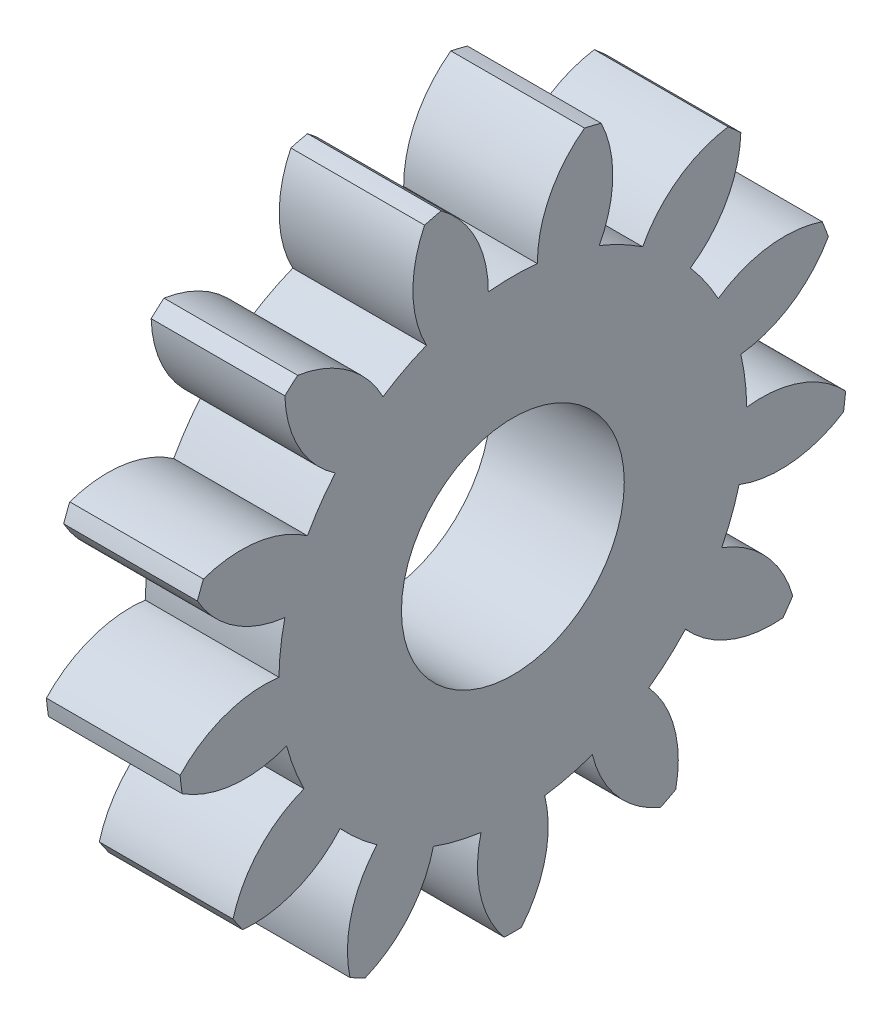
ISO-10303-21;
HEADER;
FILE_DESCRIPTION(('STEP AP214'),'2;1');
FILE_NAME('part.step','',(''),(''),'','','');
FILE_SCHEMA(('AUTOMOTIVE_DESIGN { 1 0 10303 214 1 1 1 1 }'));
ENDSEC;
DATA;
#1=APPLICATION_CONTEXT('core data for automotive mechanical design processes');
#2=APPLICATION_PROTOCOL_DEFINITION('international standard','automotive_design',2000,#1);
#3=PRODUCT_CONTEXT('',#1,'mechanical');
#4=PRODUCT('Part','Part','',(#3));
#5=PRODUCT_RELATED_PRODUCT_CATEGORY('part','',(#4));
#6=PRODUCT_DEFINITION_FORMATION('','',#4);
#7=PRODUCT_DEFINITION_CONTEXT('part definition',#1,'design');
#8=PRODUCT_DEFINITION('design','',#6,#7);
#9=PRODUCT_DEFINITION_SHAPE('','',#8);
#10=(LENGTH_UNIT() NAMED_UNIT(*) SI_UNIT(.MILLI.,.METRE.));
#11=(NAMED_UNIT(*) PLANE_ANGLE_UNIT() SI_UNIT($,.RADIAN.));
#12=(NAMED_UNIT(*) SI_UNIT($,.STERADIAN.) SOLID_ANGLE_UNIT());
#13=UNCERTAINTY_MEASURE_WITH_UNIT(LENGTH_MEASURE(1.E-05),#10,'distance_accuracy_value','');
#14=(GEOMETRIC_REPRESENTATION_CONTEXT(3) GLOBAL_UNCERTAINTY_ASSIGNED_CONTEXT((#13)) GLOBAL_UNIT_ASSIGNED_CONTEXT((#10,
#11,#12)) REPRESENTATION_CONTEXT('',''));
#15=CARTESIAN_POINT('',(0.,0.,0.));
#16=DIRECTION('',(0.,0.,1.));
#17=DIRECTION('',(1.,0.,0.));
#18=AXIS2_PLACEMENT_3D('',#15,#16,#17);
#19=CARTESIAN_POINT('',(-10.,0.,0.));
#20=DIRECTION('',(-1.,0.,0.));
#21=DIRECTION('',(0.,0.,1.));
#22=AXIS2_PLACEMENT_3D('',#19,#20,#21);
#23=CYLINDRICAL_SURFACE('',#22,7.5);
#24=CARTESIAN_POINT('',(3.,0.,0.));
#25=DIRECTION('',(1.,0.,0.));
#26=DIRECTION('',(0.,0.,-1.));
#27=AXIS2_PLACEMENT_3D('',#24,#25,#26);
#28=CIRCLE('',#27,7.5);
#29=CARTESIAN_POINT('',(3.,5.73939398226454,4.82797646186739));
#30=VERTEX_POINT('',#29);
#31=CARTESIAN_POINT('',(3.,5.48458257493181,5.11559908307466));
#32=VERTEX_POINT('',#31);
#33=EDGE_CURVE('E810',#30,#32,#28,.T.);
#34=ORIENTED_EDGE('',*,*,#33,.F.);
#35=DIRECTION('',(-1.,0.,0.));
#36=VECTOR('',#35,1.);
#37=CARTESIAN_POINT('',(5.,5.73939398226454,4.82797646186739));
#38=LINE('',#37,#36);
#39=CARTESIAN_POINT('',(0.,5.73939398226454,4.82797646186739));
#40=VERTEX_POINT('',#39);
#41=EDGE_CURVE('E555',#40,#30,#38,.F.);
#42=ORIENTED_EDGE('',*,*,#41,.F.);
#43=CARTESIAN_POINT('',(0.,0.,0.));
#44=DIRECTION('',(-1.,0.,0.));
#45=DIRECTION('',(0.,0.,1.));
#46=AXIS2_PLACEMENT_3D('',#43,#44,#45);
#47=CIRCLE('',#46,7.5);
#48=CARTESIAN_POINT('',(0.,5.48458257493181,5.11559908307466));
#49=VERTEX_POINT('',#48);
#50=EDGE_CURVE('E581',#49,#40,#47,.T.);
#51=ORIENTED_EDGE('',*,*,#50,.F.);
#52=DIRECTION('',(-1.,0.,0.));
#53=VECTOR('',#52,1.);
#54=CARTESIAN_POINT('',(5.,5.48458257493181,5.11559908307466));
#55=LINE('',#54,#53);
#56=EDGE_CURVE('E543',#32,#49,#55,.T.);
#57=ORIENTED_EDGE('',*,*,#56,.F.);
#58=EDGE_LOOP('',(#34,#42,#51,#57));
#59=FACE_BOUND('',#58,.T.);
#60=ADVANCED_FACE('F42',(#59),#23,.T.);
#61=CARTESIAN_POINT('',(3.,0.,0.));
#62=DIRECTION('',(1.,0.,0.));
#63=DIRECTION('',(0.,0.,-1.));
#64=AXIS2_PLACEMENT_3D('',#61,#62,#63);
#65=CIRCLE('',#64,7.5);
#66=CARTESIAN_POINT('',(3.,2.83830844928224,6.94219022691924));
#67=VERTEX_POINT('',#66);
#68=CARTESIAN_POINT('',(3.,2.47901925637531,7.07845064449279));
#69=VERTEX_POINT('',#68);
#70=EDGE_CURVE('E808',#67,#69,#65,.T.);
#71=ORIENTED_EDGE('',*,*,#70,.F.);
#72=DIRECTION('',(-1.,0.,0.));
#73=VECTOR('',#72,1.);
#74=CARTESIAN_POINT('',(5.,2.83830844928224,6.94219022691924));
#75=LINE('',#74,#73);
#76=CARTESIAN_POINT('',(0.,2.83830844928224,6.94219022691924));
#77=VERTEX_POINT('',#76);
#78=EDGE_CURVE('E380',#77,#67,#75,.F.);
#79=ORIENTED_EDGE('',*,*,#78,.F.);
#80=CARTESIAN_POINT('',(0.,2.47901925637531,7.07845064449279));
#81=VERTEX_POINT('',#80);
#82=EDGE_CURVE('E625',#81,#77,#47,.T.);
#83=ORIENTED_EDGE('',*,*,#82,.F.);
#84=DIRECTION('',(-1.,0.,0.));
#85=VECTOR('',#84,1.);
#86=CARTESIAN_POINT('',(5.,2.47901925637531,7.07845064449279));
#87=LINE('',#86,#85);
#88=EDGE_CURVE('E540',#69,#81,#87,.T.);
#89=ORIENTED_EDGE('',*,*,#88,.F.);
#90=EDGE_LOOP('',(#71,#79,#83,#89));
#91=FACE_BOUND('',#90,.T.);
#92=ADVANCED_FACE('F806',(#91),#23,.T.);
#93=CARTESIAN_POINT('',(3.,0.,0.));
#94=DIRECTION('',(1.,0.,0.));
#95=DIRECTION('',(0.,0.,-1.));
#96=AXIS2_PLACEMENT_3D('',#93,#94,#95);
#97=CIRCLE('',#96,7.5);
#98=CARTESIAN_POINT('',(3.,-0.712999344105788,7.46603187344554));
#99=VERTEX_POINT('',#98);
#100=CARTESIAN_POINT('',(3.,-1.0944574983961,7.41971446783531));
#101=VERTEX_POINT('',#100);
#102=EDGE_CURVE('E620',#99,#101,#97,.T.);
#103=ORIENTED_EDGE('',*,*,#102,.F.);
#104=DIRECTION('',(-1.,0.,0.));
#105=VECTOR('',#104,1.);
#106=CARTESIAN_POINT('',(5.,-0.712999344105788,7.46603187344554));
#107=LINE('',#106,#105);
#108=CARTESIAN_POINT('',(0.,-0.712999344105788,7.46603187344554));
#109=VERTEX_POINT('',#108);
#110=EDGE_CURVE('E537',#109,#99,#107,.F.);
#111=ORIENTED_EDGE('',*,*,#110,.F.);
#112=CARTESIAN_POINT('',(0.,-1.0944574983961,7.41971446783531));
#113=VERTEX_POINT('',#112);
#114=EDGE_CURVE('E619',#113,#109,#47,.T.);
#115=ORIENTED_EDGE('',*,*,#114,.F.);
#116=DIRECTION('',(-1.,0.,0.));
#117=VECTOR('',#116,1.);
#118=CARTESIAN_POINT('',(5.,-1.0944574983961,7.41971446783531));
#119=LINE('',#118,#117);
#120=EDGE_CURVE('E525',#101,#113,#119,.T.);
#121=ORIENTED_EDGE('',*,*,#120,.F.);
#122=EDGE_LOOP('',(#103,#111,#115,#121));
#123=FACE_BOUND('',#122,.T.);
#124=ADVANCED_FACE('F617',(#123),#23,.T.);
#125=CARTESIAN_POINT('',(3.,0.,0.));
#126=DIRECTION('',(1.,0.,0.));
#127=DIRECTION('',(0.,0.,-1.));
#128=AXIS2_PLACEMENT_3D('',#125,#126,#127);
#129=CIRCLE('',#128,7.5);
#130=CARTESIAN_POINT('',(3.,-4.10096758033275,6.2794955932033));
#131=VERTEX_POINT('',#130);
#132=CARTESIAN_POINT('',(3.,-4.41720722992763,6.06121112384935));
#133=VERTEX_POINT('',#132);
#134=EDGE_CURVE('E686',#131,#133,#129,.T.);
#135=ORIENTED_EDGE('',*,*,#134,.F.);
#136=DIRECTION('',(-1.,0.,0.));
#137=VECTOR('',#136,1.);
#138=CARTESIAN_POINT('',(5.,-4.10096758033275,6.2794955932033));
#139=LINE('',#138,#137);
#140=CARTESIAN_POINT('',(0.,-4.10096758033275,6.2794955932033));
#141=VERTEX_POINT('',#140);
#142=EDGE_CURVE('E522',#141,#131,#139,.F.);
#143=ORIENTED_EDGE('',*,*,#142,.F.);
#144=CARTESIAN_POINT('',(0.,-4.41720722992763,6.06121112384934));
#145=VERTEX_POINT('',#144);
#146=EDGE_CURVE('E624',#145,#141,#47,.T.);
#147=ORIENTED_EDGE('',*,*,#146,.F.);
#148=DIRECTION('',(-1.,0.,0.));
#149=VECTOR('',#148,1.);
#150=CARTESIAN_POINT('',(5.,-4.41720722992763,6.06121112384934));
#151=LINE('',#150,#149);
#152=EDGE_CURVE('E535',#133,#145,#151,.T.);
#153=ORIENTED_EDGE('',*,*,#152,.F.);
#154=EDGE_LOOP('',(#135,#143,#147,#153));
#155=FACE_BOUND('',#154,.T.);
#156=ADVANCED_FACE('F685',(#155),#23,.T.);
#157=CARTESIAN_POINT('',(3.,0.,0.));
#158=DIRECTION('',(1.,0.,0.));
#159=DIRECTION('',(0.,0.,-1.));
#160=AXIS2_PLACEMENT_3D('',#157,#158,#159);
#161=CIRCLE('',#160,7.5);
#162=CARTESIAN_POINT('',(3.,-6.54945356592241,3.65440254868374));
#163=VERTEX_POINT('',#162);
#164=CARTESIAN_POINT('',(3.,-6.72802801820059,3.31415735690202));
#165=VERTEX_POINT('',#164);
#166=EDGE_CURVE('E666',#163,#165,#161,.T.);
#167=ORIENTED_EDGE('',*,*,#166,.F.);
#168=DIRECTION('',(-1.,0.,0.));
#169=VECTOR('',#168,1.);
#170=CARTESIAN_POINT('',(5.,-6.54945356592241,3.65440254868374));
#171=LINE('',#170,#169);
#172=CARTESIAN_POINT('',(0.,-6.54945356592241,3.65440254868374));
#173=VERTEX_POINT('',#172);
#174=EDGE_CURVE('E532',#173,#163,#171,.F.);
#175=ORIENTED_EDGE('',*,*,#174,.F.);
#176=CARTESIAN_POINT('',(0.,-6.72802801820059,3.31415735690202));
#177=VERTEX_POINT('',#176);
#178=EDGE_CURVE('E627',#177,#173,#47,.T.);
#179=ORIENTED_EDGE('',*,*,#178,.F.);
#180=DIRECTION('',(-1.,0.,0.));
#181=VECTOR('',#180,1.);
#182=CARTESIAN_POINT('',(5.,-6.72802801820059,3.31415735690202));
#183=LINE('',#182,#181);
#184=EDGE_CURVE('E530',#165,#177,#183,.T.);
#185=ORIENTED_EDGE('',*,*,#184,.F.);
#186=EDGE_LOOP('',(#167,#175,#179,#185));
#187=FACE_BOUND('',#186,.T.);
#188=ADVANCED_FACE('F665',(#187),#23,.T.);
#189=CARTESIAN_POINT('',(3.,0.,0.));
#190=DIRECTION('',(1.,0.,0.));
#191=DIRECTION('',(0.,0.,-1.));
#192=AXIS2_PLACEMENT_3D('',#189,#190,#191);
#193=CIRCLE('',#192,7.5);
#194=CARTESIAN_POINT('',(3.,-7.49753866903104,0.192129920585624));
#195=VERTEX_POINT('',#194);
#196=CARTESIAN_POINT('',(3.,-7.49753866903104,-0.192129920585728));
#197=VERTEX_POINT('',#196);
#198=EDGE_CURVE('E759',#195,#197,#193,.T.);
#199=ORIENTED_EDGE('',*,*,#198,.F.);
#200=DIRECTION('',(-1.,0.,0.));
#201=VECTOR('',#200,1.);
#202=CARTESIAN_POINT('',(5.,-7.49753866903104,0.192129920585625));
#203=LINE('',#202,#201);
#204=CARTESIAN_POINT('',(0.,-7.49753866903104,0.192129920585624));
#205=VERTEX_POINT('',#204);
#206=EDGE_CURVE('E527',#205,#195,#203,.F.);
#207=ORIENTED_EDGE('',*,*,#206,.F.);
#208=CARTESIAN_POINT('',(0.,-7.49753866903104,-0.192129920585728));
#209=VERTEX_POINT('',#208);
#210=EDGE_CURVE('E651',#209,#205,#47,.T.);
#211=ORIENTED_EDGE('',*,*,#210,.F.);
#212=DIRECTION('',(-1.,0.,0.));
#213=VECTOR('',#212,1.);
#214=CARTESIAN_POINT('',(5.,-7.49753866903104,-0.192129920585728));
#215=LINE('',#214,#213);
#216=EDGE_CURVE('E510',#197,#209,#215,.T.);
#217=ORIENTED_EDGE('',*,*,#216,.F.);
#218=EDGE_LOOP('',(#199,#207,#211,#217));
#219=FACE_BOUND('',#218,.T.);
#220=ADVANCED_FACE('F944',(#219),#23,.T.);
#221=CARTESIAN_POINT('',(3.,0.,0.));
#222=DIRECTION('',(1.,0.,0.));
#223=DIRECTION('',(0.,0.,-1.));
#224=AXIS2_PLACEMENT_3D('',#221,#222,#223);
#225=CIRCLE('',#224,7.5);
#226=CARTESIAN_POINT('',(3.,-6.72802801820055,-3.31415735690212));
#227=VERTEX_POINT('',#226);
#228=CARTESIAN_POINT('',(3.,-6.54945356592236,-3.65440254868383));
#229=VERTEX_POINT('',#228);
#230=EDGE_CURVE('E781',#227,#229,#225,.T.);
#231=ORIENTED_EDGE('',*,*,#230,.F.);
#232=DIRECTION('',(-1.,0.,0.));
#233=VECTOR('',#232,1.);
#234=CARTESIAN_POINT('',(5.,-6.72802801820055,-3.31415735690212));
#235=LINE('',#234,#233);
#236=CARTESIAN_POINT('',(0.,-6.72802801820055,-3.31415735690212));
#237=VERTEX_POINT('',#236);
#238=EDGE_CURVE('E507',#237,#227,#235,.F.);
#239=ORIENTED_EDGE('',*,*,#238,.F.);
#240=CARTESIAN_POINT('',(0.,-6.54945356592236,-3.65440254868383));
#241=VERTEX_POINT('',#240);
#242=EDGE_CURVE('E647',#241,#237,#47,.T.);
#243=ORIENTED_EDGE('',*,*,#242,.F.);
#244=DIRECTION('',(-1.,0.,0.));
#245=VECTOR('',#244,1.);
#246=CARTESIAN_POINT('',(5.,-6.54945356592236,-3.65440254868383));
#247=LINE('',#246,#245);
#248=EDGE_CURVE('E520',#229,#241,#247,.T.);
#249=ORIENTED_EDGE('',*,*,#248,.F.);
#250=EDGE_LOOP('',(#231,#239,#243,#249));
#251=FACE_BOUND('',#250,.T.);
#252=ADVANCED_FACE('F929',(#251),#23,.T.);
#253=CARTESIAN_POINT('',(3.,0.,0.));
#254=DIRECTION('',(1.,0.,0.));
#255=DIRECTION('',(0.,0.,-1.));
#256=AXIS2_PLACEMENT_3D('',#253,#254,#255);
#257=CIRCLE('',#256,7.5);
#258=CARTESIAN_POINT('',(3.,-4.41720722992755,-6.06121112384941));
#259=VERTEX_POINT('',#258);
#260=CARTESIAN_POINT('',(3.,-4.10096758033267,-6.27949559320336));
#261=VERTEX_POINT('',#260);
#262=EDGE_CURVE('E801',#259,#261,#257,.T.);
#263=ORIENTED_EDGE('',*,*,#262,.F.);
#264=DIRECTION('',(-1.,0.,0.));
#265=VECTOR('',#264,1.);
#266=CARTESIAN_POINT('',(5.,-4.41720722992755,-6.06121112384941));
#267=LINE('',#266,#265);
#268=CARTESIAN_POINT('',(0.,-4.41720722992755,-6.06121112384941));
#269=VERTEX_POINT('',#268);
#270=EDGE_CURVE('E517',#269,#259,#267,.F.);
#271=ORIENTED_EDGE('',*,*,#270,.F.);
#272=CARTESIAN_POINT('',(0.,-4.10096758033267,-6.27949559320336));
#273=VERTEX_POINT('',#272);
#274=EDGE_CURVE('E643',#273,#269,#47,.T.);
#275=ORIENTED_EDGE('',*,*,#274,.F.);
#276=DIRECTION('',(-1.,0.,0.));
#277=VECTOR('',#276,1.);
#278=CARTESIAN_POINT('',(5.,-4.10096758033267,-6.27949559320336));
#279=LINE('',#278,#277);
#280=EDGE_CURVE('E515',#261,#273,#279,.T.);
#281=ORIENTED_EDGE('',*,*,#280,.F.);
#282=EDGE_LOOP('',(#263,#271,#275,#281));
#283=FACE_BOUND('',#282,.T.);
#284=ADVANCED_FACE('F914',(#283),#23,.T.);
#285=CARTESIAN_POINT('',(3.,0.,0.));
#286=DIRECTION('',(1.,0.,0.));
#287=DIRECTION('',(0.,0.,-1.));
#288=AXIS2_PLACEMENT_3D('',#285,#286,#287);
#289=CIRCLE('',#288,7.5);
#290=CARTESIAN_POINT('',(3.,-1.09445749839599,-7.41971446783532));
#291=VERTEX_POINT('',#290);
#292=CARTESIAN_POINT('',(3.,-0.712999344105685,-7.46603187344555));
#293=VERTEX_POINT('',#292);
#294=EDGE_CURVE('E779',#291,#293,#289,.T.);
#295=ORIENTED_EDGE('',*,*,#294,.F.);
#296=DIRECTION('',(-1.,0.,0.));
#297=VECTOR('',#296,1.);
#298=CARTESIAN_POINT('',(5.,-1.09445749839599,-7.41971446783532));
#299=LINE('',#298,#297);
#300=CARTESIAN_POINT('',(0.,-1.09445749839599,-7.41971446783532));
#301=VERTEX_POINT('',#300);
#302=EDGE_CURVE('E512',#301,#291,#299,.F.);
#303=ORIENTED_EDGE('',*,*,#302,.F.);
#304=CARTESIAN_POINT('',(0.,-0.712999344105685,-7.46603187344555));
#305=VERTEX_POINT('',#304);
#306=EDGE_CURVE('E639',#305,#301,#47,.T.);
#307=ORIENTED_EDGE('',*,*,#306,.F.);
#308=DIRECTION('',(-1.,0.,0.));
#309=VECTOR('',#308,1.);
#310=CARTESIAN_POINT('',(5.,-0.712999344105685,-7.46603187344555));
#311=LINE('',#310,#309);
#312=EDGE_CURVE('E505',#293,#305,#311,.T.);
#313=ORIENTED_EDGE('',*,*,#312,.F.);
#314=EDGE_LOOP('',(#295,#303,#307,#313));
#315=FACE_BOUND('',#314,.T.);
#316=ADVANCED_FACE('F899',(#315),#23,.T.);
#317=CARTESIAN_POINT('',(3.,0.,0.));
#318=DIRECTION('',(1.,0.,0.));
#319=DIRECTION('',(0.,0.,-1.));
#320=AXIS2_PLACEMENT_3D('',#317,#318,#319);
#321=CIRCLE('',#320,7.5);
#322=CARTESIAN_POINT('',(3.,2.47901925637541,-7.07845064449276));
#323=VERTEX_POINT('',#322);
#324=CARTESIAN_POINT('',(3.,2.83830844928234,-6.9421902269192));
#325=VERTEX_POINT('',#324);
#326=EDGE_CURVE('E757',#323,#325,#321,.T.);
#327=ORIENTED_EDGE('',*,*,#326,.F.);
#328=DIRECTION('',(-1.,0.,0.));
#329=VECTOR('',#328,1.);
#330=CARTESIAN_POINT('',(5.,2.47901925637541,-7.07845064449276));
#331=LINE('',#330,#329);
#332=CARTESIAN_POINT('',(0.,2.47901925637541,-7.07845064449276));
#333=VERTEX_POINT('',#332);
#334=EDGE_CURVE('E502',#333,#323,#331,.F.);
#335=ORIENTED_EDGE('',*,*,#334,.F.);
#336=CARTESIAN_POINT('',(0.,2.83830844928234,-6.9421902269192));
#337=VERTEX_POINT('',#336);
#338=EDGE_CURVE('E635',#337,#333,#47,.T.);
#339=ORIENTED_EDGE('',*,*,#338,.F.);
#340=DIRECTION('',(-1.,0.,0.));
#341=VECTOR('',#340,1.);
#342=CARTESIAN_POINT('',(5.,2.83830844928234,-6.9421902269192));
#343=LINE('',#342,#341);
#344=EDGE_CURVE('E389',#325,#337,#343,.T.);
#345=ORIENTED_EDGE('',*,*,#344,.F.);
#346=EDGE_LOOP('',(#327,#335,#339,#345));
#347=FACE_BOUND('',#346,.T.);
#348=ADVANCED_FACE('F884',(#347),#23,.T.);
#349=CARTESIAN_POINT('',(3.,0.,0.));
#350=DIRECTION('',(1.,0.,0.));
#351=DIRECTION('',(0.,0.,-1.));
#352=AXIS2_PLACEMENT_3D('',#349,#350,#351);
#353=CIRCLE('',#352,7.5);
#354=CARTESIAN_POINT('',(3.,5.48458257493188,-5.11559908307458));
#355=VERTEX_POINT('',#354);
#356=CARTESIAN_POINT('',(3.,5.73939398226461,-4.82797646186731));
#357=VERTEX_POINT('',#356);
#358=EDGE_CURVE('E736',#355,#357,#353,.T.);
#359=ORIENTED_EDGE('',*,*,#358,.F.);
#360=DIRECTION('',(-1.,0.,0.));
#361=VECTOR('',#360,1.);
#362=CARTESIAN_POINT('',(5.,5.48458257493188,-5.11559908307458));
#363=LINE('',#362,#361);
#364=CARTESIAN_POINT('',(0.,5.48458257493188,-5.11559908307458));
#365=VERTEX_POINT('',#364);
#366=EDGE_CURVE('E386',#365,#355,#363,.F.);
#367=ORIENTED_EDGE('',*,*,#366,.F.);
#368=CARTESIAN_POINT('',(0.,5.73939398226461,-4.82797646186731));
#369=VERTEX_POINT('',#368);
#370=EDGE_CURVE('E580',#369,#365,#47,.T.);
#371=ORIENTED_EDGE('',*,*,#370,.F.);
#372=DIRECTION('',(-1.,0.,0.));
#373=VECTOR('',#372,1.);
#374=CARTESIAN_POINT('',(5.,5.73939398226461,-4.82797646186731));
#375=LINE('',#374,#373);
#376=EDGE_CURVE('E500',#357,#369,#375,.T.);
#377=ORIENTED_EDGE('',*,*,#376,.F.);
#378=EDGE_LOOP('',(#359,#367,#371,#377));
#379=FACE_BOUND('',#378,.T.);
#380=ADVANCED_FACE('F870',(#379),#23,.T.);
#381=CARTESIAN_POINT('',(3.,0.,0.));
#382=DIRECTION('',(1.,0.,0.));
#383=DIRECTION('',(0.,0.,-1.));
#384=AXIS2_PLACEMENT_3D('',#381,#382,#383);
#385=CIRCLE('',#384,7.5);
#386=CARTESIAN_POINT('',(3.,7.23369412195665,-1.9808254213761));
#387=VERTEX_POINT('',#386);
#388=CARTESIAN_POINT('',(3.,7.32565352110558,-1.60773147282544));
#389=VERTEX_POINT('',#388);
#390=EDGE_CURVE('E718',#387,#389,#385,.T.);
#391=ORIENTED_EDGE('',*,*,#390,.F.);
#392=DIRECTION('',(-1.,0.,0.));
#393=VECTOR('',#392,1.);
#394=CARTESIAN_POINT('',(5.,7.23369412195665,-1.9808254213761));
#395=LINE('',#394,#393);
#396=CARTESIAN_POINT('',(0.,7.23369412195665,-1.9808254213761));
#397=VERTEX_POINT('',#396);
#398=EDGE_CURVE('E497',#397,#387,#395,.F.);
#399=ORIENTED_EDGE('',*,*,#398,.F.);
#400=CARTESIAN_POINT('',(0.,7.32565352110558,-1.60773147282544));
#401=VERTEX_POINT('',#400);
#402=EDGE_CURVE('E576',#401,#397,#47,.T.);
#403=ORIENTED_EDGE('',*,*,#402,.F.);
#404=DIRECTION('',(-1.,0.,0.));
#405=VECTOR('',#404,1.);
#406=CARTESIAN_POINT('',(5.,7.32565352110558,-1.60773147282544));
#407=LINE('',#406,#405);
#408=EDGE_CURVE('E573',#389,#401,#407,.T.);
#409=ORIENTED_EDGE('',*,*,#408,.F.);
#410=EDGE_LOOP('',(#391,#399,#403,#409));
#411=FACE_BOUND('',#410,.T.);
#412=ADVANCED_FACE('F853',(#411),#23,.T.);
#413=CARTESIAN_POINT('',(3.,0.,0.));
#414=DIRECTION('',(1.,0.,0.));
#415=DIRECTION('',(0.,0.,-1.));
#416=AXIS2_PLACEMENT_3D('',#413,#414,#415);
#417=CIRCLE('',#416,7.5);
#418=CARTESIAN_POINT('',(3.,7.32565352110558,1.60773147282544));
#419=VERTEX_POINT('',#418);
#420=CARTESIAN_POINT('',(3.,7.23369412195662,1.9808254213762));
#421=VERTEX_POINT('',#420);
#422=EDGE_CURVE('E706',#419,#421,#417,.T.);
#423=ORIENTED_EDGE('',*,*,#422,.F.);
#424=DIRECTION('',(-1.,0.,0.));
#425=VECTOR('',#424,1.);
#426=CARTESIAN_POINT('',(5.,7.32565352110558,1.60773147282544));
#427=LINE('',#426,#425);
#428=CARTESIAN_POINT('',(0.,7.32565352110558,1.60773147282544));
#429=VERTEX_POINT('',#428);
#430=EDGE_CURVE('E570',#429,#419,#427,.F.);
#431=ORIENTED_EDGE('',*,*,#430,.F.);
#432=CARTESIAN_POINT('',(0.,7.23369412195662,1.9808254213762));
#433=VERTEX_POINT('',#432);
#434=EDGE_CURVE('E575',#433,#429,#47,.T.);
#435=ORIENTED_EDGE('',*,*,#434,.F.);
#436=DIRECTION('',(-1.,0.,0.));
#437=VECTOR('',#436,1.);
#438=CARTESIAN_POINT('',(5.,7.23369412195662,1.9808254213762));
#439=LINE('',#438,#437);
#440=EDGE_CURVE('E558',#421,#433,#439,.T.);
#441=ORIENTED_EDGE('',*,*,#440,.F.);
#442=EDGE_LOOP('',(#423,#431,#435,#441));
#443=FACE_BOUND('',#442,.T.);
#444=ADVANCED_FACE('F838',(#443),#23,.T.);
#445=CARTESIAN_POINT('',(10.,5.23281005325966,-3.15045835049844));
#446=DIRECTION('',(-1.,0.,0.));
#447=DIRECTION('',(0.,0.,1.));
#448=AXIS2_PLACEMENT_3D('',#445,#446,#447);
#449=CYLINDRICAL_SURFACE('',#448,2.6);
#450=DIRECTION('',(-1.,0.,0.));
#451=VECTOR('',#450,1.);
#452=CARTESIAN_POINT('',(10.,5.22005384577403,-0.550489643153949));
#453=LINE('',#452,#451);
#454=CARTESIAN_POINT('',(3.,5.22005384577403,-0.550489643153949));
#455=VERTEX_POINT('',#454);
#456=CARTESIAN_POINT('',(0.,5.22005384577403,-0.550489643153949));
#457=VERTEX_POINT('',#456);
#458=EDGE_CURVE('E566',#455,#457,#453,.T.);
#459=ORIENTED_EDGE('',*,*,#458,.F.);
#460=CARTESIAN_POINT('',(3.,5.23281005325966,-3.15045835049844));
#461=DIRECTION('',(1.,0.,0.));
#462=DIRECTION('',(0.,0.,-1.));
#463=AXIS2_PLACEMENT_3D('',#460,#461,#462);
#464=CIRCLE('',#463,2.6);
#465=EDGE_CURVE('E715',#455,#389,#464,.F.);
#466=ORIENTED_EDGE('',*,*,#465,.T.);
#467=ORIENTED_EDGE('',*,*,#408,.T.);
#468=CARTESIAN_POINT('',(0.,5.23281005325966,-3.15045835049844));
#469=DIRECTION('',(-1.,0.,0.));
#470=DIRECTION('',(0.,0.,-1.));
#471=AXIS2_PLACEMENT_3D('',#468,#469,#470);
#472=CIRCLE('',#471,2.6);
#473=EDGE_CURVE('E560',#457,#401,#472,.T.);
#474=ORIENTED_EDGE('',*,*,#473,.F.);
#475=EDGE_LOOP('',(#459,#466,#467,#474));
#476=FACE_BOUND('',#475,.T.);
#477=ADVANCED_FACE('F849',(#476),#449,.T.);
#478=CARTESIAN_POINT('',(10.,5.23281005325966,3.15045835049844));
#479=DIRECTION('',(-1.,0.,0.));
#480=DIRECTION('',(0.,0.,1.));
#481=AXIS2_PLACEMENT_3D('',#478,#479,#480);
#482=CYLINDRICAL_SURFACE('',#481,2.6);
#483=ORIENTED_EDGE('',*,*,#430,.T.);
#484=CARTESIAN_POINT('',(3.,5.23281005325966,3.15045835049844));
#485=DIRECTION('',(1.,0.,0.));
#486=DIRECTION('',(0.,0.,-1.));
#487=AXIS2_PLACEMENT_3D('',#484,#485,#486);
#488=CIRCLE('',#487,2.6);
#489=CARTESIAN_POINT('',(3.,5.22005384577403,0.550489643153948));
#490=VERTEX_POINT('',#489);
#491=EDGE_CURVE('E702',#419,#490,#488,.F.);
#492=ORIENTED_EDGE('',*,*,#491,.T.);
#493=DIRECTION('',(-1.,0.,0.));
#494=VECTOR('',#493,1.);
#495=CARTESIAN_POINT('',(10.,5.22005384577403,0.550489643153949));
#496=LINE('',#495,#494);
#497=CARTESIAN_POINT('',(0.,5.22005384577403,0.550489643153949));
#498=VERTEX_POINT('',#497);
#499=EDGE_CURVE('E568',#490,#498,#496,.T.);
#500=ORIENTED_EDGE('',*,*,#499,.T.);
#501=CARTESIAN_POINT('',(0.,5.23281005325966,3.15045835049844));
#502=DIRECTION('',(1.,0.,0.));
#503=DIRECTION('',(0.,0.,-1.));
#504=AXIS2_PLACEMENT_3D('',#501,#502,#503);
#505=CIRCLE('',#504,2.6);
#506=EDGE_CURVE('E579',#498,#429,#505,.T.);
#507=ORIENTED_EDGE('',*,*,#506,.T.);
#508=EDGE_LOOP('',(#483,#492,#500,#507));
#509=FACE_BOUND('',#508,.T.);
#510=ADVANCED_FACE('F840',(#509),#482,.T.);
#511=CARTESIAN_POINT('',(10.,0.,0.));
#512=DIRECTION('',(-1.,0.,0.));
#513=DIRECTION('',(0.,0.,1.));
#514=AXIS2_PLACEMENT_3D('',#511,#512,#513);
#515=CYLINDRICAL_SURFACE('',#514,5.249);
#516=ORIENTED_EDGE('',*,*,#499,.F.);
#517=CARTESIAN_POINT('',(3.,0.,0.));
#518=DIRECTION('',(1.,0.,0.));
#519=DIRECTION('',(0.,0.,-1.));
#520=AXIS2_PLACEMENT_3D('',#517,#518,#519);
#521=CIRCLE('',#520,5.249);
#522=EDGE_CURVE('E712',#490,#455,#521,.F.);
#523=ORIENTED_EDGE('',*,*,#522,.T.);
#524=ORIENTED_EDGE('',*,*,#458,.T.);
#525=CARTESIAN_POINT('',(0.,0.,0.));
#526=DIRECTION('',(-1.,0.,0.));
#527=DIRECTION('',(0.,0.,-1.));
#528=AXIS2_PLACEMENT_3D('',#525,#526,#527);
#529=CIRCLE('',#528,5.249);
#530=EDGE_CURVE('E563',#498,#457,#529,.T.);
#531=ORIENTED_EDGE('',*,*,#530,.F.);
#532=EDGE_LOOP('',(#516,#523,#524,#531));
#533=FACE_BOUND('',#532,.T.);
#534=ADVANCED_FACE('F846',(#533),#515,.T.);
#535=CARTESIAN_POINT('',(10.,6.09751419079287,-0.357784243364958));
#536=DIRECTION('',(-1.,0.,0.));
#537=DIRECTION('',(0.,0.,1.));
#538=AXIS2_PLACEMENT_3D('',#535,#536,#537);
#539=CYLINDRICAL_SURFACE('',#538,2.6);
#540=DIRECTION('',(-1.,0.,0.));
#541=VECTOR('',#540,1.);
#542=CARTESIAN_POINT('',(10.,4.87795342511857,1.93844560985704));
#543=LINE('',#542,#541);
#544=CARTESIAN_POINT('',(3.,4.87795342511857,1.93844560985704));
#545=VERTEX_POINT('',#544);
#546=CARTESIAN_POINT('',(0.,4.87795342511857,1.93844560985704));
#547=VERTEX_POINT('',#546);
#548=EDGE_CURVE('E551',#545,#547,#543,.T.);
#549=ORIENTED_EDGE('',*,*,#548,.F.);
#550=CARTESIAN_POINT('',(3.,6.09751419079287,-0.357784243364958));
#551=DIRECTION('',(1.,0.,0.));
#552=DIRECTION('',(0.,0.,-1.));
#553=AXIS2_PLACEMENT_3D('',#550,#551,#552);
#554=CIRCLE('',#553,2.6);
#555=EDGE_CURVE('E828',#545,#421,#554,.F.);
#556=ORIENTED_EDGE('',*,*,#555,.T.);
#557=ORIENTED_EDGE('',*,*,#440,.T.);
#558=CARTESIAN_POINT('',(0.,6.09751419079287,-0.357784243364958));
#559=DIRECTION('',(-1.,0.,0.));
#560=DIRECTION('',(0.,0.46472317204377,-0.885456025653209));
#561=AXIS2_PLACEMENT_3D('',#558,#559,#560);
#562=CIRCLE('',#561,2.6);
#563=EDGE_CURVE('E545',#547,#433,#562,.T.);
#564=ORIENTED_EDGE('',*,*,#563,.F.);
#565=EDGE_LOOP('',(#549,#556,#557,#564));
#566=FACE_BOUND('',#565,.T.);
#567=ADVANCED_FACE('F836',(#566),#539,.T.);
#568=CARTESIAN_POINT('',(10.,3.16933219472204,5.22140041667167));
#569=DIRECTION('',(-1.,0.,0.));
#570=DIRECTION('',(0.,0.,1.));
#571=AXIS2_PLACEMENT_3D('',#568,#569,#570);
#572=CYLINDRICAL_SURFACE('',#571,2.6);
#573=ORIENTED_EDGE('',*,*,#41,.T.);
#574=CARTESIAN_POINT('',(3.,3.16933219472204,5.22140041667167));
#575=DIRECTION('',(1.,0.,0.));
#576=DIRECTION('',(0.,0.,-1.));
#577=AXIS2_PLACEMENT_3D('',#574,#575,#576);
#578=CIRCLE('',#577,2.6);
#579=CARTESIAN_POINT('',(3.,4.36630283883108,2.91331435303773));
#580=VERTEX_POINT('',#579);
#581=EDGE_CURVE('E817',#30,#580,#578,.F.);
#582=ORIENTED_EDGE('',*,*,#581,.T.);
#583=DIRECTION('',(-1.,0.,0.));
#584=VECTOR('',#583,1.);
#585=CARTESIAN_POINT('',(10.,4.36630283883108,2.91331435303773));
#586=LINE('',#585,#584);
#587=CARTESIAN_POINT('',(0.,4.36630283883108,2.91331435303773));
#588=VERTEX_POINT('',#587);
#589=EDGE_CURVE('E553',#580,#588,#586,.T.);
#590=ORIENTED_EDGE('',*,*,#589,.T.);
#591=CARTESIAN_POINT('',(0.,3.16933219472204,5.22140041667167));
#592=DIRECTION('',(1.,0.,0.));
#593=DIRECTION('',(0.,0.,-1.));
#594=AXIS2_PLACEMENT_3D('',#591,#592,#593);
#595=CIRCLE('',#594,2.6);
#596=EDGE_CURVE('E584',#588,#40,#595,.T.);
#597=ORIENTED_EDGE('',*,*,#596,.T.);
#598=EDGE_LOOP('',(#573,#582,#590,#597));
#599=FACE_BOUND('',#598,.T.);
#600=ADVANCED_FACE('F1124',(#599),#572,.T.);
#601=CARTESIAN_POINT('',(10.,0.,0.));
#602=DIRECTION('',(-1.,0.,0.));
#603=DIRECTION('',(0.,0.,1.));
#604=AXIS2_PLACEMENT_3D('',#601,#602,#603);
#605=CYLINDRICAL_SURFACE('',#604,5.249);
#606=ORIENTED_EDGE('',*,*,#589,.F.);
#607=CARTESIAN_POINT('',(3.,0.,0.));
#608=DIRECTION('',(1.,0.,0.));
#609=DIRECTION('',(0.,0.,-1.));
#610=AXIS2_PLACEMENT_3D('',#607,#608,#609);
#611=CIRCLE('',#610,5.249);
#612=EDGE_CURVE('E825',#580,#545,#611,.F.);
#613=ORIENTED_EDGE('',*,*,#612,.T.);
#614=ORIENTED_EDGE('',*,*,#548,.T.);
#615=CARTESIAN_POINT('',(0.,0.,0.));
#616=DIRECTION('',(-1.,0.,0.));
#617=DIRECTION('',(0.,0.46472317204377,-0.885456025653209));
#618=AXIS2_PLACEMENT_3D('',#615,#616,#617);
#619=CIRCLE('',#618,5.249);
#620=EDGE_CURVE('E548',#588,#547,#619,.T.);
#621=ORIENTED_EDGE('',*,*,#620,.F.);
#622=EDGE_LOOP('',(#606,#613,#614,#621));
#623=FACE_BOUND('',#622,.T.);
#624=ADVANCED_FACE('F1133',(#623),#605,.T.);
#625=CARTESIAN_POINT('',(10.,0.379798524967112,-6.09618257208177));
#626=DIRECTION('',(-1.,0.,0.));
#627=DIRECTION('',(0.,0.,1.));
#628=AXIS2_PLACEMENT_3D('',#625,#626,#627);
#629=CYLINDRICAL_SURFACE('',#628,2.6);
#630=DIRECTION('',(-1.,0.,0.));
#631=VECTOR('',#630,1.);
#632=CARTESIAN_POINT('',(10.,2.51228447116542,-4.6087338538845));
#633=LINE('',#632,#631);
#634=CARTESIAN_POINT('',(3.,2.51228447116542,-4.6087338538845));
#635=VERTEX_POINT('',#634);
#636=CARTESIAN_POINT('',(0.,2.51228447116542,-4.6087338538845));
#637=VERTEX_POINT('',#636);
#638=EDGE_CURVE('E493',#635,#637,#633,.T.);
#639=ORIENTED_EDGE('',*,*,#638,.F.);
#640=CARTESIAN_POINT('',(3.,0.379798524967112,-6.09618257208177));
#641=DIRECTION('',(1.,0.,0.));
#642=DIRECTION('',(0.,0.,-1.));
#643=AXIS2_PLACEMENT_3D('',#640,#641,#642);
#644=CIRCLE('',#643,2.6);
#645=EDGE_CURVE('E754',#635,#325,#644,.F.);
#646=ORIENTED_EDGE('',*,*,#645,.T.);
#647=ORIENTED_EDGE('',*,*,#344,.T.);
#648=CARTESIAN_POINT('',(0.,0.379798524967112,-6.09618257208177));
#649=DIRECTION('',(-1.,0.,0.));
#650=DIRECTION('',(0.,-0.822983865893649,-0.568064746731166));
#651=AXIS2_PLACEMENT_3D('',#648,#649,#650);
#652=CIRCLE('',#651,2.6);
#653=EDGE_CURVE('E487',#637,#337,#652,.T.);
#654=ORIENTED_EDGE('',*,*,#653,.F.);
#655=EDGE_LOOP('',(#639,#646,#647,#654));
#656=FACE_BOUND('',#655,.T.);
#657=ADVANCED_FACE('F880',(#656),#629,.T.);
#658=CARTESIAN_POINT('',(10.,5.56535131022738,-2.51685392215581));
#659=DIRECTION('',(-1.,0.,0.));
#660=DIRECTION('',(0.,0.,1.));
#661=AXIS2_PLACEMENT_3D('',#658,#659,#660);
#662=CYLINDRICAL_SURFACE('',#661,2.6);
#663=ORIENTED_EDGE('',*,*,#366,.T.);
#664=CARTESIAN_POINT('',(3.,5.56535131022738,-2.51685392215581));
#665=DIRECTION('',(1.,0.,0.));
#666=DIRECTION('',(0.,0.,-1.));
#667=AXIS2_PLACEMENT_3D('',#664,#665,#666);
#668=CIRCLE('',#667,2.6);
#669=CARTESIAN_POINT('',(3.,3.41837266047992,-3.98330633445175));
#670=VERTEX_POINT('',#669);
#671=EDGE_CURVE('E742',#355,#670,#668,.F.);
#672=ORIENTED_EDGE('',*,*,#671,.T.);
#673=DIRECTION('',(-1.,0.,0.));
#674=VECTOR('',#673,1.);
#675=CARTESIAN_POINT('',(10.,3.41837266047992,-3.98330633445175));
#676=LINE('',#675,#674);
#677=CARTESIAN_POINT('',(0.,3.41837266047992,-3.98330633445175));
#678=VERTEX_POINT('',#677);
#679=EDGE_CURVE('E470',#670,#678,#676,.T.);
#680=ORIENTED_EDGE('',*,*,#679,.T.);
#681=CARTESIAN_POINT('',(0.,5.56535131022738,-2.51685392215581));
#682=DIRECTION('',(1.,0.,0.));
#683=DIRECTION('',(0.,0.,-1.));
#684=AXIS2_PLACEMENT_3D('',#681,#682,#683);
#685=CIRCLE('',#684,2.6);
#686=EDGE_CURVE('E587',#678,#365,#685,.T.);
#687=ORIENTED_EDGE('',*,*,#686,.T.);
#688=EDGE_LOOP('',(#663,#672,#680,#687));
#689=FACE_BOUND('',#688,.T.);
#690=ADVANCED_FACE('F872',(#689),#662,.T.);
#691=CARTESIAN_POINT('',(10.,0.,0.));
#692=DIRECTION('',(-1.,0.,0.));
#693=DIRECTION('',(0.,0.,1.));
#694=AXIS2_PLACEMENT_3D('',#691,#692,#693);
#695=CYLINDRICAL_SURFACE('',#694,5.249);
#696=ORIENTED_EDGE('',*,*,#679,.F.);
#697=CARTESIAN_POINT('',(3.,0.,0.));
#698=DIRECTION('',(1.,0.,0.));
#699=DIRECTION('',(0.,0.,-1.));
#700=AXIS2_PLACEMENT_3D('',#697,#698,#699);
#701=CIRCLE('',#700,5.249);
#702=EDGE_CURVE('E751',#670,#635,#701,.F.);
#703=ORIENTED_EDGE('',*,*,#702,.T.);
#704=ORIENTED_EDGE('',*,*,#638,.T.);
#705=CARTESIAN_POINT('',(0.,0.,0.));
#706=DIRECTION('',(-1.,0.,0.));
#707=DIRECTION('',(0.,-0.822983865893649,-0.568064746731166));
#708=AXIS2_PLACEMENT_3D('',#705,#706,#707);
#709=CIRCLE('',#708,5.249);
#710=EDGE_CURVE('E490',#678,#637,#709,.T.);
#711=ORIENTED_EDGE('',*,*,#710,.F.);
#712=EDGE_LOOP('',(#696,#703,#704,#711));
#713=FACE_BOUND('',#712,.T.);
#714=ADVANCED_FACE('F877',(#713),#695,.T.);
#715=CARTESIAN_POINT('',(10.,3.16933219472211,-5.22140041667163));
#716=DIRECTION('',(-1.,0.,0.));
#717=DIRECTION('',(0.,0.,1.));
#718=AXIS2_PLACEMENT_3D('',#715,#716,#717);
#719=CYLINDRICAL_SURFACE('',#718,2.6);
#720=DIRECTION('',(-1.,0.,0.));
#721=VECTOR('',#720,1.);
#722=CARTESIAN_POINT('',(10.,4.36630283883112,-2.91331435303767));
#723=LINE('',#722,#721);
#724=CARTESIAN_POINT('',(3.,4.36630283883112,-2.91331435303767));
#725=VERTEX_POINT('',#724);
#726=CARTESIAN_POINT('',(0.,4.36630283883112,-2.91331435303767));
#727=VERTEX_POINT('',#726);
#728=EDGE_CURVE('E483',#725,#727,#723,.T.);
#729=ORIENTED_EDGE('',*,*,#728,.F.);
#730=CARTESIAN_POINT('',(3.,3.16933219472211,-5.22140041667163));
#731=DIRECTION('',(1.,0.,0.));
#732=DIRECTION('',(0.,0.,-1.));
#733=AXIS2_PLACEMENT_3D('',#730,#731,#732);
#734=CIRCLE('',#733,2.6);
#735=EDGE_CURVE('E733',#725,#357,#734,.F.);
#736=ORIENTED_EDGE('',*,*,#735,.T.);
#737=ORIENTED_EDGE('',*,*,#376,.T.);
#738=CARTESIAN_POINT('',(0.,3.16933219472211,-5.22140041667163));
#739=DIRECTION('',(-1.,0.,0.));
#740=DIRECTION('',(0.,-0.464723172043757,-0.885456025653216));
#741=AXIS2_PLACEMENT_3D('',#738,#739,#740);
#742=CIRCLE('',#741,2.6);
#743=EDGE_CURVE('E476',#727,#369,#742,.T.);
#744=ORIENTED_EDGE('',*,*,#743,.F.);
#745=EDGE_LOOP('',(#729,#736,#737,#744));
#746=FACE_BOUND('',#745,.T.);
#747=ADVANCED_FACE('F865',(#746),#719,.T.);
#748=CARTESIAN_POINT('',(10.,6.09751419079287,0.357784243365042));
#749=DIRECTION('',(-1.,0.,0.));
#750=DIRECTION('',(0.,0.,1.));
#751=AXIS2_PLACEMENT_3D('',#748,#749,#750);
#752=CYLINDRICAL_SURFACE('',#751,2.6);
#753=ORIENTED_EDGE('',*,*,#398,.T.);
#754=CARTESIAN_POINT('',(3.,6.09751419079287,0.357784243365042));
#755=DIRECTION('',(1.,0.,0.));
#756=DIRECTION('',(0.,0.,-1.));
#757=AXIS2_PLACEMENT_3D('',#754,#755,#756);
#758=CIRCLE('',#757,2.6);
#759=CARTESIAN_POINT('',(3.,4.8779534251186,-1.93844560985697));
#760=VERTEX_POINT('',#759);
#761=EDGE_CURVE('E724',#387,#760,#758,.F.);
#762=ORIENTED_EDGE('',*,*,#761,.T.);
#763=DIRECTION('',(-1.,0.,0.));
#764=VECTOR('',#763,1.);
#765=CARTESIAN_POINT('',(10.,4.8779534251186,-1.93844560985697));
#766=LINE('',#765,#764);
#767=CARTESIAN_POINT('',(0.,4.8779534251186,-1.93844560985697));
#768=VERTEX_POINT('',#767);
#769=EDGE_CURVE('E485',#760,#768,#766,.T.);
#770=ORIENTED_EDGE('',*,*,#769,.T.);
#771=CARTESIAN_POINT('',(0.,6.09751419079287,0.357784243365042));
#772=DIRECTION('',(1.,0.,0.));
#773=DIRECTION('',(0.,0.,-1.));
#774=AXIS2_PLACEMENT_3D('',#771,#772,#773);
#775=CIRCLE('',#774,2.6);
#776=EDGE_CURVE('E589',#768,#397,#775,.T.);
#777=ORIENTED_EDGE('',*,*,#776,.T.);
#778=EDGE_LOOP('',(#753,#762,#770,#777));
#779=FACE_BOUND('',#778,.T.);
#780=ADVANCED_FACE('F858',(#779),#752,.T.);
#781=CARTESIAN_POINT('',(10.,0.,0.));
#782=DIRECTION('',(-1.,0.,0.));
#783=DIRECTION('',(0.,0.,1.));
#784=AXIS2_PLACEMENT_3D('',#781,#782,#783);
#785=CYLINDRICAL_SURFACE('',#784,5.249);
#786=ORIENTED_EDGE('',*,*,#769,.F.);
#787=CARTESIAN_POINT('',(3.,0.,0.));
#788=DIRECTION('',(1.,0.,0.));
#789=DIRECTION('',(0.,0.,-1.));
#790=AXIS2_PLACEMENT_3D('',#787,#788,#789);
#791=CIRCLE('',#790,5.249);
#792=EDGE_CURVE('E730',#760,#725,#791,.F.);
#793=ORIENTED_EDGE('',*,*,#792,.T.);
#794=ORIENTED_EDGE('',*,*,#728,.T.);
#795=CARTESIAN_POINT('',(0.,0.,0.));
#796=DIRECTION('',(-1.,0.,0.));
#797=DIRECTION('',(0.,-0.464723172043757,-0.885456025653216));
#798=AXIS2_PLACEMENT_3D('',#795,#796,#797);
#799=CIRCLE('',#798,5.249);
#800=EDGE_CURVE('E479',#768,#727,#799,.T.);
#801=ORIENTED_EDGE('',*,*,#800,.F.);
#802=EDGE_LOOP('',(#786,#793,#794,#801));
#803=FACE_BOUND('',#802,.T.);
#804=ADVANCED_FACE('F861',(#803),#785,.T.);
#805=CARTESIAN_POINT('',(10.,-2.49674240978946,-5.57440276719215));
#806=DIRECTION('',(-1.,0.,0.));
#807=DIRECTION('',(0.,0.,1.));
#808=AXIS2_PLACEMENT_3D('',#805,#806,#807);
#809=CYLINDRICAL_SURFACE('',#808,2.6);
#810=DIRECTION('',(-1.,0.,0.));
#811=VECTOR('',#810,1.);
#812=CARTESIAN_POINT('',(10.,0.0827320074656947,-5.24834797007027));
#813=LINE('',#812,#811);
#814=CARTESIAN_POINT('',(3.,0.0827320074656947,-5.24834797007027));
#815=VERTEX_POINT('',#814);
#816=CARTESIAN_POINT('',(0.,0.0827320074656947,-5.24834797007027));
#817=VERTEX_POINT('',#816);
#818=EDGE_CURVE('E473',#815,#817,#813,.T.);
#819=ORIENTED_EDGE('',*,*,#818,.F.);
#820=CARTESIAN_POINT('',(3.,-2.49674240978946,-5.57440276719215));
#821=DIRECTION('',(1.,0.,0.));
#822=DIRECTION('',(0.,0.,-1.));
#823=AXIS2_PLACEMENT_3D('',#820,#821,#822);
#824=CIRCLE('',#823,2.6);
#825=EDGE_CURVE('E776',#815,#293,#824,.F.);
#826=ORIENTED_EDGE('',*,*,#825,.T.);
#827=ORIENTED_EDGE('',*,*,#312,.T.);
#828=CARTESIAN_POINT('',(0.,-2.49674240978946,-5.57440276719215));
#829=DIRECTION('',(-1.,0.,0.));
#830=DIRECTION('',(0.,-0.992708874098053,-0.120536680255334));
#831=AXIS2_PLACEMENT_3D('',#828,#829,#830);
#832=CIRCLE('',#831,2.6);
#833=EDGE_CURVE('E466',#817,#305,#832,.T.);
#834=ORIENTED_EDGE('',*,*,#833,.F.);
#835=EDGE_LOOP('',(#819,#826,#827,#834));
#836=FACE_BOUND('',#835,.T.);
#837=ADVANCED_FACE('F895',(#836),#809,.T.);
#838=CARTESIAN_POINT('',(10.,3.75823351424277,-4.81491118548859));
#839=DIRECTION('',(-1.,0.,0.));
#840=DIRECTION('',(0.,0.,1.));
#841=AXIS2_PLACEMENT_3D('',#838,#839,#840);
#842=CYLINDRICAL_SURFACE('',#841,2.6);
#843=ORIENTED_EDGE('',*,*,#334,.T.);
#844=CARTESIAN_POINT('',(3.,3.75823351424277,-4.81491118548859));
#845=DIRECTION('',(1.,0.,0.));
#846=DIRECTION('',(0.,0.,-1.));
#847=AXIS2_PLACEMENT_3D('',#844,#845,#846);
#848=CIRCLE('',#847,2.6);
#849=CARTESIAN_POINT('',(3.,1.17568391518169,-5.11563958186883));
#850=VERTEX_POINT('',#849);
#851=EDGE_CURVE('E764',#323,#850,#848,.F.);
#852=ORIENTED_EDGE('',*,*,#851,.T.);
#853=DIRECTION('',(-1.,0.,0.));
#854=VECTOR('',#853,1.);
#855=CARTESIAN_POINT('',(10.,1.17568391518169,-5.11563958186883));
#856=LINE('',#855,#854);
#857=CARTESIAN_POINT('',(0.,1.17568391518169,-5.11563958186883));
#858=VERTEX_POINT('',#857);
#859=EDGE_CURVE('E440',#850,#858,#856,.T.);
#860=ORIENTED_EDGE('',*,*,#859,.T.);
#861=CARTESIAN_POINT('',(0.,3.75823351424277,-4.81491118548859));
#862=DIRECTION('',(1.,0.,0.));
#863=DIRECTION('',(0.,0.,-1.));
#864=AXIS2_PLACEMENT_3D('',#861,#862,#863);
#865=CIRCLE('',#864,2.6);
#866=EDGE_CURVE('E591',#858,#333,#865,.T.);
#867=ORIENTED_EDGE('',*,*,#866,.T.);
#868=EDGE_LOOP('',(#843,#852,#860,#867));
#869=FACE_BOUND('',#868,.T.);
#870=ADVANCED_FACE('F887',(#869),#842,.T.);
#871=CARTESIAN_POINT('',(10.,0.,0.));
#872=DIRECTION('',(-1.,0.,0.));
#873=DIRECTION('',(0.,0.,1.));
#874=AXIS2_PLACEMENT_3D('',#871,#872,#873);
#875=CYLINDRICAL_SURFACE('',#874,5.249);
#876=ORIENTED_EDGE('',*,*,#859,.F.);
#877=CARTESIAN_POINT('',(3.,0.,0.));
#878=DIRECTION('',(1.,0.,0.));
#879=DIRECTION('',(0.,0.,-1.));
#880=AXIS2_PLACEMENT_3D('',#877,#878,#879);
#881=CIRCLE('',#880,5.249);
#882=EDGE_CURVE('E773',#850,#815,#881,.F.);
#883=ORIENTED_EDGE('',*,*,#882,.T.);
#884=ORIENTED_EDGE('',*,*,#818,.T.);
#885=CARTESIAN_POINT('',(0.,0.,0.));
#886=DIRECTION('',(-1.,0.,0.));
#887=DIRECTION('',(0.,-0.992708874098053,-0.120536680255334));
#888=AXIS2_PLACEMENT_3D('',#885,#886,#887);
#889=CIRCLE('',#888,5.249);
#890=EDGE_CURVE('E469',#858,#817,#889,.T.);
#891=ORIENTED_EDGE('',*,*,#890,.F.);
#892=EDGE_LOOP('',(#876,#883,#884,#891));
#893=FACE_BOUND('',#892,.T.);
#894=ADVANCED_FACE('F892',(#893),#875,.T.);
#895=CARTESIAN_POINT('',(10.,-5.83470813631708,1.80661834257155));
#896=DIRECTION('',(-1.,0.,0.));
#897=DIRECTION('',(0.,0.,1.));
#898=AXIS2_PLACEMENT_3D('',#895,#896,#897);
#899=CYLINDRICAL_SURFACE('',#898,2.6);
#900=DIRECTION('',(-1.,0.,0.));
#901=VECTOR('',#900,1.);
#902=CARTESIAN_POINT('',(10.,-5.20010936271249,-0.714747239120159));
#903=LINE('',#902,#901);
#904=CARTESIAN_POINT('',(3.,-5.20010936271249,-0.714747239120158));
#905=VERTEX_POINT('',#904);
#906=CARTESIAN_POINT('',(0.,-5.20010936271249,-0.714747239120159));
#907=VERTEX_POINT('',#906);
#908=EDGE_CURVE('E463',#905,#907,#903,.T.);
#909=ORIENTED_EDGE('',*,*,#908,.F.);
#910=CARTESIAN_POINT('',(3.,-5.83470813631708,1.80661834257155));
#911=DIRECTION('',(1.,0.,0.));
#912=DIRECTION('',(0.,0.,-1.));
#913=AXIS2_PLACEMENT_3D('',#910,#911,#912);
#914=CIRCLE('',#913,2.6);
#915=EDGE_CURVE('E761',#905,#197,#914,.F.);
#916=ORIENTED_EDGE('',*,*,#915,.T.);
#917=ORIENTED_EDGE('',*,*,#216,.T.);
#918=CARTESIAN_POINT('',(0.,-5.83470813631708,1.80661834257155));
#919=DIRECTION('',(-1.,0.,0.));
#920=DIRECTION('',(0.,-0.239315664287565,0.97094181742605));
#921=AXIS2_PLACEMENT_3D('',#918,#919,#920);
#922=CIRCLE('',#921,2.6);
#923=EDGE_CURVE('E457',#907,#209,#922,.T.);
#924=ORIENTED_EDGE('',*,*,#923,.F.);
#925=EDGE_LOOP('',(#909,#916,#917,#924));
#926=FACE_BOUND('',#925,.T.);
#927=ADVANCED_FACE('F940',(#926),#899,.T.);
#928=CARTESIAN_POINT('',(10.,-4.3268000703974,-4.31120517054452));
#929=DIRECTION('',(-1.,0.,0.));
#930=DIRECTION('',(0.,0.,1.));
#931=AXIS2_PLACEMENT_3D('',#928,#929,#930);
#932=CYLINDRICAL_SURFACE('',#931,2.6);
#933=ORIENTED_EDGE('',*,*,#238,.T.);
#934=CARTESIAN_POINT('',(3.,-4.3268000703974,-4.31120517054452));
#935=DIRECTION('',(1.,0.,0.));
#936=DIRECTION('',(0.,0.,-1.));
#937=AXIS2_PLACEMENT_3D('',#934,#935,#936);
#938=CIRCLE('',#937,2.6);
#939=CARTESIAN_POINT('',(3.,-4.93662777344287,-1.78373406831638));
#940=VERTEX_POINT('',#939);
#941=EDGE_CURVE('E770',#227,#940,#938,.F.);
#942=ORIENTED_EDGE('',*,*,#941,.T.);
#943=DIRECTION('',(-1.,0.,0.));
#944=VECTOR('',#943,1.);
#945=CARTESIAN_POINT('',(10.,-4.93662777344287,-1.78373406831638));
#946=LINE('',#945,#944);
#947=CARTESIAN_POINT('',(0.,-4.93662777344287,-1.78373406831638));
#948=VERTEX_POINT('',#947);
#949=EDGE_CURVE('E410',#940,#948,#946,.T.);
#950=ORIENTED_EDGE('',*,*,#949,.T.);
#951=CARTESIAN_POINT('',(0.,-4.3268000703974,-4.31120517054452));
#952=DIRECTION('',(1.,0.,0.));
#953=DIRECTION('',(0.,0.,-1.));
#954=AXIS2_PLACEMENT_3D('',#951,#952,#953);
#955=CIRCLE('',#954,2.6);
#956=EDGE_CURVE('E593',#948,#237,#955,.T.);
#957=ORIENTED_EDGE('',*,*,#956,.T.);
#958=EDGE_LOOP('',(#933,#942,#950,#957));
#959=FACE_BOUND('',#958,.T.);
#960=ADVANCED_FACE('F932',(#959),#932,.T.);
#961=CARTESIAN_POINT('',(10.,0.,0.));
#962=DIRECTION('',(-1.,0.,0.));
#963=DIRECTION('',(0.,0.,1.));
#964=AXIS2_PLACEMENT_3D('',#961,#962,#963);
#965=CYLINDRICAL_SURFACE('',#964,5.249);
#966=ORIENTED_EDGE('',*,*,#949,.F.);
#967=CARTESIAN_POINT('',(3.,0.,0.));
#968=DIRECTION('',(1.,0.,0.));
#969=DIRECTION('',(0.,0.,-1.));
#970=AXIS2_PLACEMENT_3D('',#967,#968,#969);
#971=CIRCLE('',#970,5.249);
#972=EDGE_CURVE('E767',#940,#905,#971,.F.);
#973=ORIENTED_EDGE('',*,*,#972,.T.);
#974=ORIENTED_EDGE('',*,*,#908,.T.);
#975=CARTESIAN_POINT('',(0.,0.,0.));
#976=DIRECTION('',(-1.,0.,0.));
#977=DIRECTION('',(0.,-0.239315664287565,0.97094181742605));
#978=AXIS2_PLACEMENT_3D('',#975,#976,#977);
#979=CIRCLE('',#978,5.249);
#980=EDGE_CURVE('E460',#948,#907,#979,.T.);
#981=ORIENTED_EDGE('',*,*,#980,.F.);
#982=EDGE_LOOP('',(#966,#973,#974,#981));
#983=FACE_BOUND('',#982,.T.);
#984=ADVANCED_FACE('F937',(#983),#965,.T.);
#985=CARTESIAN_POINT('',(10.,-4.80130974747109,-3.77559446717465));
#986=DIRECTION('',(-1.,0.,0.));
#987=DIRECTION('',(0.,0.,1.));
#988=AXIS2_PLACEMENT_3D('',#985,#986,#987);
#989=CYLINDRICAL_SURFACE('',#988,2.6);
#990=DIRECTION('',(-1.,0.,0.));
#991=VECTOR('',#990,1.);
#992=CARTESIAN_POINT('',(10.,-2.36577336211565,-4.68562881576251));
#993=LINE('',#992,#991);
#994=CARTESIAN_POINT('',(3.,-2.36577336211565,-4.68562881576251));
#995=VERTEX_POINT('',#994);
#996=CARTESIAN_POINT('',(0.,-2.36577336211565,-4.68562881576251));
#997=VERTEX_POINT('',#996);
#998=EDGE_CURVE('E443',#995,#997,#993,.T.);
#999=ORIENTED_EDGE('',*,*,#998,.F.);
#1000=CARTESIAN_POINT('',(3.,-4.80130974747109,-3.77559446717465));
#1001=DIRECTION('',(1.,0.,0.));
#1002=DIRECTION('',(0.,0.,-1.));
#1003=AXIS2_PLACEMENT_3D('',#1000,#1001,#1002);
#1004=CIRCLE('',#1003,2.6);
#1005=EDGE_CURVE('E798',#995,#261,#1004,.F.);
#1006=ORIENTED_EDGE('',*,*,#1005,.T.);
#1007=ORIENTED_EDGE('',*,*,#280,.T.);
#1008=CARTESIAN_POINT('',(0.,-4.80130974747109,-3.77559446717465));
#1009=DIRECTION('',(-1.,0.,0.));
#1010=DIRECTION('',(0.,-0.935016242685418,0.354604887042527));
#1011=AXIS2_PLACEMENT_3D('',#1008,#1009,#1010);
#1012=CIRCLE('',#1011,2.6);
#1013=EDGE_CURVE('E436',#997,#273,#1012,.T.);
#1014=ORIENTED_EDGE('',*,*,#1013,.F.);
#1015=EDGE_LOOP('',(#999,#1006,#1007,#1014));
#1016=FACE_BOUND('',#1015,.T.);
#1017=ADVANCED_FACE('F910',(#1016),#989,.T.);
#1018=CARTESIAN_POINT('',(10.,1.09014971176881,-6.00993032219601));
#1019=DIRECTION('',(-1.,0.,0.));
#1020=DIRECTION('',(0.,0.,1.));
#1021=AXIS2_PLACEMENT_3D('',#1018,#1019,#1020);
#1022=CYLINDRICAL_SURFACE('',#1021,2.6);
#1023=ORIENTED_EDGE('',*,*,#302,.T.);
#1024=CARTESIAN_POINT('',(3.,1.09014971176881,-6.00993032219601));
#1025=DIRECTION('',(1.,0.,0.));
#1026=DIRECTION('',(0.,0.,-1.));
#1027=AXIS2_PLACEMENT_3D('',#1024,#1025,#1026);
#1028=CIRCLE('',#1027,2.6);
#1029=CARTESIAN_POINT('',(3.,-1.33633984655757,-5.07604145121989));
#1030=VERTEX_POINT('',#1029);
#1031=EDGE_CURVE('E786',#291,#1030,#1028,.F.);
#1032=ORIENTED_EDGE('',*,*,#1031,.T.);
#1033=DIRECTION('',(-1.,0.,0.));
#1034=VECTOR('',#1033,1.);
#1035=CARTESIAN_POINT('',(10.,-1.33633984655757,-5.07604145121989));
#1036=LINE('',#1035,#1034);
#1037=CARTESIAN_POINT('',(0.,-1.33633984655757,-5.07604145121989));
#1038=VERTEX_POINT('',#1037);
#1039=EDGE_CURVE('E445',#1030,#1038,#1036,.T.);
#1040=ORIENTED_EDGE('',*,*,#1039,.T.);
#1041=CARTESIAN_POINT('',(0.,1.09014971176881,-6.00993032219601));
#1042=DIRECTION('',(1.,0.,0.));
#1043=DIRECTION('',(0.,0.,-1.));
#1044=AXIS2_PLACEMENT_3D('',#1041,#1042,#1043);
#1045=CIRCLE('',#1044,2.6);
#1046=EDGE_CURVE('E595',#1038,#301,#1045,.T.);
#1047=ORIENTED_EDGE('',*,*,#1046,.T.);
#1048=EDGE_LOOP('',(#1023,#1032,#1040,#1047));
#1049=FACE_BOUND('',#1048,.T.);
#1050=ADVANCED_FACE('F902',(#1049),#1022,.T.);
#1051=CARTESIAN_POINT('',(10.,0.,0.));
#1052=DIRECTION('',(-1.,0.,0.));
#1053=DIRECTION('',(0.,0.,1.));
#1054=AXIS2_PLACEMENT_3D('',#1051,#1052,#1053);
#1055=CYLINDRICAL_SURFACE('',#1054,5.249);
#1056=ORIENTED_EDGE('',*,*,#1039,.F.);
#1057=CARTESIAN_POINT('',(3.,0.,0.));
#1058=DIRECTION('',(1.,0.,0.));
#1059=DIRECTION('',(0.,0.,-1.));
#1060=AXIS2_PLACEMENT_3D('',#1057,#1058,#1059);
#1061=CIRCLE('',#1060,5.249);
#1062=EDGE_CURVE('E795',#1030,#995,#1061,.F.);
#1063=ORIENTED_EDGE('',*,*,#1062,.T.);
#1064=ORIENTED_EDGE('',*,*,#998,.T.);
#1065=CARTESIAN_POINT('',(0.,0.,0.));
#1066=DIRECTION('',(-1.,0.,0.));
#1067=DIRECTION('',(0.,-0.935016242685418,0.354604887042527));
#1068=AXIS2_PLACEMENT_3D('',#1065,#1066,#1067);
#1069=CIRCLE('',#1068,5.249);
#1070=EDGE_CURVE('E439',#1038,#997,#1069,.T.);
#1071=ORIENTED_EDGE('',*,*,#1070,.F.);
#1072=EDGE_LOOP('',(#1056,#1063,#1064,#1071));
#1073=FACE_BOUND('',#1072,.T.);
#1074=ADVANCED_FACE('F907',(#1073),#1055,.T.);
#1075=CARTESIAN_POINT('',(10.,-6.00595488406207,-1.11184297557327));
#1076=DIRECTION('',(-1.,0.,0.));
#1077=DIRECTION('',(0.,0.,1.));
#1078=AXIS2_PLACEMENT_3D('',#1075,#1076,#1077);
#1079=CYLINDRICAL_SURFACE('',#1078,2.6);
#1080=DIRECTION('',(-1.,0.,0.));
#1081=VECTOR('',#1080,1.);
#1082=CARTESIAN_POINT('',(10.,-4.272308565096,-3.04948856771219));
#1083=LINE('',#1082,#1081);
#1084=CARTESIAN_POINT('',(3.,-4.272308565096,-3.04948856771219));
#1085=VERTEX_POINT('',#1084);
#1086=CARTESIAN_POINT('',(0.,-4.272308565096,-3.04948856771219));
#1087=VERTEX_POINT('',#1086);
#1088=EDGE_CURVE('E453',#1085,#1087,#1083,.T.);
#1089=ORIENTED_EDGE('',*,*,#1088,.F.);
#1090=CARTESIAN_POINT('',(3.,-6.00595488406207,-1.11184297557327));
#1091=DIRECTION('',(1.,0.,0.));
#1092=DIRECTION('',(0.,0.,-1.));
#1093=AXIS2_PLACEMENT_3D('',#1090,#1091,#1092);
#1094=CIRCLE('',#1093,2.6);
#1095=EDGE_CURVE('E783',#1085,#229,#1094,.F.);
#1096=ORIENTED_EDGE('',*,*,#1095,.T.);
#1097=ORIENTED_EDGE('',*,*,#248,.T.);
#1098=CARTESIAN_POINT('',(0.,-6.00595488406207,-1.11184297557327));
#1099=DIRECTION('',(-1.,0.,0.));
#1100=DIRECTION('',(0.,-0.663122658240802,0.748510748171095));
#1101=AXIS2_PLACEMENT_3D('',#1098,#1099,#1100);
#1102=CIRCLE('',#1101,2.6);
#1103=EDGE_CURVE('E447',#1087,#241,#1102,.T.);
#1104=ORIENTED_EDGE('',*,*,#1103,.F.);
#1105=EDGE_LOOP('',(#1089,#1096,#1097,#1104));
#1106=FACE_BOUND('',#1105,.T.);
#1107=ADVANCED_FACE('F925',(#1106),#1079,.T.);
#1108=CARTESIAN_POINT('',(10.,-1.82767425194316,-5.8281468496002));
#1109=DIRECTION('',(-1.,0.,0.));
#1110=DIRECTION('',(0.,0.,1.));
#1111=AXIS2_PLACEMENT_3D('',#1108,#1109,#1110);
#1112=CYLINDRICAL_SURFACE('',#1111,2.6);
#1113=ORIENTED_EDGE('',*,*,#270,.T.);
#1114=CARTESIAN_POINT('',(3.,-1.82767425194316,-5.8281468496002));
#1115=DIRECTION('',(1.,0.,0.));
#1116=DIRECTION('',(0.,0.,-1.));
#1117=AXIS2_PLACEMENT_3D('',#1114,#1115,#1116);
#1118=CIRCLE('',#1117,2.6);
#1119=CARTESIAN_POINT('',(3.,-3.54222425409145,-3.8735833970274));
#1120=VERTEX_POINT('',#1119);
#1121=EDGE_CURVE('E792',#259,#1120,#1118,.F.);
#1122=ORIENTED_EDGE('',*,*,#1121,.T.);
#1123=DIRECTION('',(-1.,0.,0.));
#1124=VECTOR('',#1123,1.);
#1125=CARTESIAN_POINT('',(10.,-3.54222425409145,-3.8735833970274));
#1126=LINE('',#1125,#1124);
#1127=CARTESIAN_POINT('',(0.,-3.54222425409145,-3.8735833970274));
#1128=VERTEX_POINT('',#1127);
#1129=EDGE_CURVE('E455',#1120,#1128,#1126,.T.);
#1130=ORIENTED_EDGE('',*,*,#1129,.T.);
#1131=CARTESIAN_POINT('',(0.,-1.82767425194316,-5.8281468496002));
#1132=DIRECTION('',(1.,0.,0.));
#1133=DIRECTION('',(0.,0.,-1.));
#1134=AXIS2_PLACEMENT_3D('',#1131,#1132,#1133);
#1135=CIRCLE('',#1134,2.6);
#1136=EDGE_CURVE('E597',#1128,#269,#1135,.T.);
#1137=ORIENTED_EDGE('',*,*,#1136,.T.);
#1138=EDGE_LOOP('',(#1113,#1122,#1130,#1137));
#1139=FACE_BOUND('',#1138,.T.);
#1140=ADVANCED_FACE('F917',(#1139),#1112,.T.);
#1141=CARTESIAN_POINT('',(10.,0.,0.));
#1142=DIRECTION('',(-1.,0.,0.));
#1143=DIRECTION('',(0.,0.,1.));
#1144=AXIS2_PLACEMENT_3D('',#1141,#1142,#1143);
#1145=CYLINDRICAL_SURFACE('',#1144,5.249);
#1146=ORIENTED_EDGE('',*,*,#1129,.F.);
#1147=CARTESIAN_POINT('',(3.,0.,0.));
#1148=DIRECTION('',(1.,0.,0.));
#1149=DIRECTION('',(0.,0.,-1.));
#1150=AXIS2_PLACEMENT_3D('',#1147,#1148,#1149);
#1151=CIRCLE('',#1150,5.249);
#1152=EDGE_CURVE('E789',#1120,#1085,#1151,.F.);
#1153=ORIENTED_EDGE('',*,*,#1152,.T.);
#1154=ORIENTED_EDGE('',*,*,#1088,.T.);
#1155=CARTESIAN_POINT('',(0.,0.,0.));
#1156=DIRECTION('',(-1.,0.,0.));
#1157=DIRECTION('',(0.,-0.663122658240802,0.748510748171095));
#1158=AXIS2_PLACEMENT_3D('',#1155,#1156,#1157);
#1159=CIRCLE('',#1158,5.249);
#1160=EDGE_CURVE('E450',#1128,#1087,#1159,.T.);
#1161=ORIENTED_EDGE('',*,*,#1160,.F.);
#1162=EDGE_LOOP('',(#1146,#1153,#1154,#1161));
#1163=FACE_BOUND('',#1162,.T.);
#1164=ADVANCED_FACE('F922',(#1163),#1145,.T.);
#1165=CARTESIAN_POINT('',(10.,1.09014971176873,6.00993032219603));
#1166=DIRECTION('',(-1.,0.,0.));
#1167=DIRECTION('',(0.,0.,1.));
#1168=AXIS2_PLACEMENT_3D('',#1165,#1166,#1167);
#1169=CYLINDRICAL_SURFACE('',#1168,2.6);
#1170=DIRECTION('',(-1.,0.,0.));
#1171=VECTOR('',#1170,1.);
#1172=CARTESIAN_POINT('',(10.,-1.33633984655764,5.07604145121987));
#1173=LINE('',#1172,#1171);
#1174=CARTESIAN_POINT('',(3.,-1.33633984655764,5.07604145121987));
#1175=VERTEX_POINT('',#1174);
#1176=CARTESIAN_POINT('',(0.,-1.33633984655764,5.07604145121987));
#1177=VERTEX_POINT('',#1176);
#1178=EDGE_CURVE('E433',#1175,#1177,#1173,.T.);
#1179=ORIENTED_EDGE('',*,*,#1178,.F.);
#1180=CARTESIAN_POINT('',(3.,1.09014971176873,6.00993032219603));
#1181=DIRECTION('',(1.,0.,0.));
#1182=DIRECTION('',(0.,0.,-1.));
#1183=AXIS2_PLACEMENT_3D('',#1180,#1181,#1182);
#1184=CIRCLE('',#1183,2.6);
#1185=EDGE_CURVE('E701',#1175,#101,#1184,.F.);
#1186=ORIENTED_EDGE('',*,*,#1185,.T.);
#1187=ORIENTED_EDGE('',*,*,#120,.T.);
#1188=CARTESIAN_POINT('',(0.,1.09014971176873,6.00993032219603));
#1189=DIRECTION('',(-1.,0.,0.));
#1190=DIRECTION('',(0.,0.935016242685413,0.35460488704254));
#1191=AXIS2_PLACEMENT_3D('',#1188,#1189,#1190);
#1192=CIRCLE('',#1191,2.6);
#1193=EDGE_CURVE('E427',#1177,#113,#1192,.T.);
#1194=ORIENTED_EDGE('',*,*,#1193,.F.);
#1195=EDGE_LOOP('',(#1179,#1186,#1187,#1194));
#1196=FACE_BOUND('',#1195,.T.);
#1197=ADVANCED_FACE('F700',(#1196),#1169,.T.);
#1198=CARTESIAN_POINT('',(10.,-4.80130974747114,3.77559446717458));
#1199=DIRECTION('',(-1.,0.,0.));
#1200=DIRECTION('',(0.,0.,1.));
#1201=AXIS2_PLACEMENT_3D('',#1198,#1199,#1200);
#1202=CYLINDRICAL_SURFACE('',#1201,2.6);
#1203=ORIENTED_EDGE('',*,*,#142,.T.);
#1204=CARTESIAN_POINT('',(3.,-4.80130974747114,3.77559446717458));
#1205=DIRECTION('',(1.,0.,0.));
#1206=DIRECTION('',(0.,0.,-1.));
#1207=AXIS2_PLACEMENT_3D('',#1204,#1205,#1206);
#1208=CIRCLE('',#1207,2.6);
#1209=CARTESIAN_POINT('',(3.,-2.36577336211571,4.68562881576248));
#1210=VERTEX_POINT('',#1209);
#1211=EDGE_CURVE('E690',#131,#1210,#1208,.F.);
#1212=ORIENTED_EDGE('',*,*,#1211,.T.);
#1213=DIRECTION('',(-1.,0.,0.));
#1214=VECTOR('',#1213,1.);
#1215=CARTESIAN_POINT('',(10.,-2.36577336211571,4.68562881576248));
#1216=LINE('',#1215,#1214);
#1217=CARTESIAN_POINT('',(0.,-2.36577336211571,4.68562881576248));
#1218=VERTEX_POINT('',#1217);
#1219=EDGE_CURVE('E398',#1210,#1218,#1216,.T.);
#1220=ORIENTED_EDGE('',*,*,#1219,.T.);
#1221=CARTESIAN_POINT('',(0.,-4.80130974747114,3.77559446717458));
#1222=DIRECTION('',(1.,0.,0.));
#1223=DIRECTION('',(0.,0.,-1.));
#1224=AXIS2_PLACEMENT_3D('',#1221,#1222,#1223);
#1225=CIRCLE('',#1224,2.6);
#1226=EDGE_CURVE('E599',#1218,#141,#1225,.T.);
#1227=ORIENTED_EDGE('',*,*,#1226,.T.);
#1228=EDGE_LOOP('',(#1203,#1212,#1220,#1227));
#1229=FACE_BOUND('',#1228,.T.);
#1230=ADVANCED_FACE('F689',(#1229),#1202,.T.);
#1231=CARTESIAN_POINT('',(10.,0.,0.));
#1232=DIRECTION('',(-1.,0.,0.));
#1233=DIRECTION('',(0.,0.,1.));
#1234=AXIS2_PLACEMENT_3D('',#1231,#1232,#1233);
#1235=CYLINDRICAL_SURFACE('',#1234,5.249);
#1236=ORIENTED_EDGE('',*,*,#1219,.F.);
#1237=CARTESIAN_POINT('',(3.,0.,0.));
#1238=DIRECTION('',(1.,0.,0.));
#1239=DIRECTION('',(0.,0.,-1.));
#1240=AXIS2_PLACEMENT_3D('',#1237,#1238,#1239);
#1241=CIRCLE('',#1240,5.249);
#1242=EDGE_CURVE('E697',#1210,#1175,#1241,.F.);
#1243=ORIENTED_EDGE('',*,*,#1242,.T.);
#1244=ORIENTED_EDGE('',*,*,#1178,.T.);
#1245=CARTESIAN_POINT('',(0.,0.,0.));
#1246=DIRECTION('',(-1.,0.,0.));
#1247=DIRECTION('',(0.,0.935016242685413,0.35460488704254));
#1248=AXIS2_PLACEMENT_3D('',#1245,#1246,#1247);
#1249=CIRCLE('',#1248,5.249);
#1250=EDGE_CURVE('E430',#1218,#1177,#1249,.T.);
#1251=ORIENTED_EDGE('',*,*,#1250,.F.);
#1252=EDGE_LOOP('',(#1236,#1243,#1244,#1251));
#1253=FACE_BOUND('',#1252,.T.);
#1254=ADVANCED_FACE('F694',(#1253),#1235,.T.);
#1255=CARTESIAN_POINT('',(10.,-4.32680007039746,4.31120517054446));
#1256=DIRECTION('',(-1.,0.,0.));
#1257=DIRECTION('',(0.,0.,1.));
#1258=AXIS2_PLACEMENT_3D('',#1255,#1256,#1257);
#1259=CYLINDRICAL_SURFACE('',#1258,2.6);
#1260=DIRECTION('',(-1.,0.,0.));
#1261=VECTOR('',#1260,1.);
#1262=CARTESIAN_POINT('',(10.,-4.93662777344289,1.78373406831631));
#1263=LINE('',#1262,#1261);
#1264=CARTESIAN_POINT('',(3.,-4.93662777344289,1.78373406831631));
#1265=VERTEX_POINT('',#1264);
#1266=CARTESIAN_POINT('',(0.,-4.93662777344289,1.78373406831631));
#1267=VERTEX_POINT('',#1266);
#1268=EDGE_CURVE('E413',#1265,#1267,#1263,.T.);
#1269=ORIENTED_EDGE('',*,*,#1268,.F.);
#1270=CARTESIAN_POINT('',(3.,-4.32680007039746,4.31120517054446));
#1271=DIRECTION('',(1.,0.,0.));
#1272=DIRECTION('',(0.,0.,-1.));
#1273=AXIS2_PLACEMENT_3D('',#1270,#1271,#1272);
#1274=CIRCLE('',#1273,2.6);
#1275=EDGE_CURVE('E739',#1265,#165,#1274,.F.);
#1276=ORIENTED_EDGE('',*,*,#1275,.T.);
#1277=ORIENTED_EDGE('',*,*,#184,.T.);
#1278=CARTESIAN_POINT('',(0.,-4.32680007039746,4.31120517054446));
#1279=DIRECTION('',(-1.,0.,0.));
#1280=DIRECTION('',(0.,0.239315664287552,0.970941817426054));
#1281=AXIS2_PLACEMENT_3D('',#1278,#1279,#1280);
#1282=CIRCLE('',#1281,2.6);
#1283=EDGE_CURVE('E406',#1267,#177,#1282,.T.);
#1284=ORIENTED_EDGE('',*,*,#1283,.F.);
#1285=EDGE_LOOP('',(#1269,#1276,#1277,#1284));
#1286=FACE_BOUND('',#1285,.T.);
#1287=ADVANCED_FACE('F954',(#1286),#1259,.T.);
#1288=CARTESIAN_POINT('',(10.,-5.83470813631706,-1.80661834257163));
#1289=DIRECTION('',(-1.,0.,0.));
#1290=DIRECTION('',(0.,0.,1.));
#1291=AXIS2_PLACEMENT_3D('',#1288,#1289,#1290);
#1292=CYLINDRICAL_SURFACE('',#1291,2.6);
#1293=ORIENTED_EDGE('',*,*,#206,.T.);
#1294=CARTESIAN_POINT('',(3.,-5.83470813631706,-1.80661834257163));
#1295=DIRECTION('',(1.,0.,0.));
#1296=DIRECTION('',(0.,0.,-1.));
#1297=AXIS2_PLACEMENT_3D('',#1294,#1295,#1296);
#1298=CIRCLE('',#1297,2.6);
#1299=CARTESIAN_POINT('',(3.,-5.2001093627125,0.714747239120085));
#1300=VERTEX_POINT('',#1299);
#1301=EDGE_CURVE('E748',#195,#1300,#1298,.F.);
#1302=ORIENTED_EDGE('',*,*,#1301,.T.);
#1303=DIRECTION('',(-1.,0.,0.));
#1304=VECTOR('',#1303,1.);
#1305=CARTESIAN_POINT('',(10.,-5.2001093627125,0.714747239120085));
#1306=LINE('',#1305,#1304);
#1307=CARTESIAN_POINT('',(0.,-5.2001093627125,0.714747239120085));
#1308=VERTEX_POINT('',#1307);
#1309=EDGE_CURVE('E415',#1300,#1308,#1306,.T.);
#1310=ORIENTED_EDGE('',*,*,#1309,.T.);
#1311=CARTESIAN_POINT('',(0.,-5.83470813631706,-1.80661834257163));
#1312=DIRECTION('',(1.,0.,0.));
#1313=DIRECTION('',(0.,0.,-1.));
#1314=AXIS2_PLACEMENT_3D('',#1311,#1312,#1313);
#1315=CIRCLE('',#1314,2.6);
#1316=EDGE_CURVE('E601',#1308,#205,#1315,.T.);
#1317=ORIENTED_EDGE('',*,*,#1316,.T.);
#1318=EDGE_LOOP('',(#1293,#1302,#1310,#1317));
#1319=FACE_BOUND('',#1318,.T.);
#1320=ADVANCED_FACE('F947',(#1319),#1292,.T.);
#1321=CARTESIAN_POINT('',(10.,0.,0.));
#1322=DIRECTION('',(-1.,0.,0.));
#1323=DIRECTION('',(0.,0.,1.));
#1324=AXIS2_PLACEMENT_3D('',#1321,#1322,#1323);
#1325=CYLINDRICAL_SURFACE('',#1324,5.249);
#1326=ORIENTED_EDGE('',*,*,#1309,.F.);
#1327=CARTESIAN_POINT('',(3.,0.,0.));
#1328=DIRECTION('',(1.,0.,0.));
#1329=DIRECTION('',(0.,0.,-1.));
#1330=AXIS2_PLACEMENT_3D('',#1327,#1328,#1329);
#1331=CIRCLE('',#1330,5.249);
#1332=EDGE_CURVE('E745',#1300,#1265,#1331,.F.);
#1333=ORIENTED_EDGE('',*,*,#1332,.T.);
#1334=ORIENTED_EDGE('',*,*,#1268,.T.);
#1335=CARTESIAN_POINT('',(0.,0.,0.));
#1336=DIRECTION('',(-1.,0.,0.));
#1337=DIRECTION('',(0.,0.239315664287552,0.970941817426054));
#1338=AXIS2_PLACEMENT_3D('',#1335,#1336,#1337);
#1339=CIRCLE('',#1338,5.249);
#1340=EDGE_CURVE('E409',#1308,#1267,#1339,.T.);
#1341=ORIENTED_EDGE('',*,*,#1340,.F.);
#1342=EDGE_LOOP('',(#1326,#1333,#1334,#1341));
#1343=FACE_BOUND('',#1342,.T.);
#1344=ADVANCED_FACE('F951',(#1343),#1325,.T.);
#1345=CARTESIAN_POINT('',(10.,-1.82767425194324,5.82814684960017));
#1346=DIRECTION('',(-1.,0.,0.));
#1347=DIRECTION('',(0.,0.,1.));
#1348=AXIS2_PLACEMENT_3D('',#1345,#1346,#1347);
#1349=CYLINDRICAL_SURFACE('',#1348,2.6);
#1350=DIRECTION('',(-1.,0.,0.));
#1351=VECTOR('',#1350,1.);
#1352=CARTESIAN_POINT('',(10.,-3.5422242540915,3.87358339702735));
#1353=LINE('',#1352,#1351);
#1354=CARTESIAN_POINT('',(3.,-3.5422242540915,3.87358339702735));
#1355=VERTEX_POINT('',#1354);
#1356=CARTESIAN_POINT('',(0.,-3.5422242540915,3.87358339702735));
#1357=VERTEX_POINT('',#1356);
#1358=EDGE_CURVE('E423',#1355,#1357,#1353,.T.);
#1359=ORIENTED_EDGE('',*,*,#1358,.F.);
#1360=CARTESIAN_POINT('',(3.,-1.82767425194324,5.82814684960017));
#1361=DIRECTION('',(1.,0.,0.));
#1362=DIRECTION('',(0.,0.,-1.));
#1363=AXIS2_PLACEMENT_3D('',#1360,#1361,#1362);
#1364=CIRCLE('',#1363,2.6);
#1365=EDGE_CURVE('E721',#1355,#133,#1364,.F.);
#1366=ORIENTED_EDGE('',*,*,#1365,.T.);
#1367=ORIENTED_EDGE('',*,*,#152,.T.);
#1368=CARTESIAN_POINT('',(0.,-1.82767425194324,5.82814684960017));
#1369=DIRECTION('',(-1.,0.,0.));
#1370=DIRECTION('',(0.,0.663122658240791,0.748510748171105));
#1371=AXIS2_PLACEMENT_3D('',#1368,#1369,#1370);
#1372=CIRCLE('',#1371,2.6);
#1373=EDGE_CURVE('E417',#1357,#145,#1372,.T.);
#1374=ORIENTED_EDGE('',*,*,#1373,.F.);
#1375=EDGE_LOOP('',(#1359,#1366,#1367,#1374));
#1376=FACE_BOUND('',#1375,.T.);
#1377=ADVANCED_FACE('F955',(#1376),#1349,.T.);
#1378=CARTESIAN_POINT('',(10.,-6.00595488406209,1.11184297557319));
#1379=DIRECTION('',(-1.,0.,0.));
#1380=DIRECTION('',(0.,0.,1.));
#1381=AXIS2_PLACEMENT_3D('',#1378,#1379,#1380);
#1382=CYLINDRICAL_SURFACE('',#1381,2.6);
#1383=ORIENTED_EDGE('',*,*,#174,.T.);
#1384=CARTESIAN_POINT('',(3.,-6.00595488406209,1.11184297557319));
#1385=DIRECTION('',(1.,0.,0.));
#1386=DIRECTION('',(0.,0.,-1.));
#1387=AXIS2_PLACEMENT_3D('',#1384,#1385,#1386);
#1388=CIRCLE('',#1387,2.6);
#1389=CARTESIAN_POINT('',(3.,-4.27230856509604,3.04948856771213));
#1390=VERTEX_POINT('',#1389);
#1391=EDGE_CURVE('E670',#163,#1390,#1388,.F.);
#1392=ORIENTED_EDGE('',*,*,#1391,.T.);
#1393=DIRECTION('',(-1.,0.,0.));
#1394=VECTOR('',#1393,1.);
#1395=CARTESIAN_POINT('',(10.,-4.27230856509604,3.04948856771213));
#1396=LINE('',#1395,#1394);
#1397=CARTESIAN_POINT('',(0.,-4.27230856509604,3.04948856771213));
#1398=VERTEX_POINT('',#1397);
#1399=EDGE_CURVE('E425',#1390,#1398,#1396,.T.);
#1400=ORIENTED_EDGE('',*,*,#1399,.T.);
#1401=CARTESIAN_POINT('',(0.,-6.00595488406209,1.11184297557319));
#1402=DIRECTION('',(1.,0.,0.));
#1403=DIRECTION('',(0.,0.,-1.));
#1404=AXIS2_PLACEMENT_3D('',#1401,#1402,#1403);
#1405=CIRCLE('',#1404,2.6);
#1406=EDGE_CURVE('E603',#1398,#173,#1405,.T.);
#1407=ORIENTED_EDGE('',*,*,#1406,.T.);
#1408=EDGE_LOOP('',(#1383,#1392,#1400,#1407));
#1409=FACE_BOUND('',#1408,.T.);
#1410=ADVANCED_FACE('F669',(#1409),#1382,.T.);
#1411=CARTESIAN_POINT('',(10.,0.,0.));
#1412=DIRECTION('',(-1.,0.,0.));
#1413=DIRECTION('',(0.,0.,1.));
#1414=AXIS2_PLACEMENT_3D('',#1411,#1412,#1413);
#1415=CYLINDRICAL_SURFACE('',#1414,5.249);
#1416=ORIENTED_EDGE('',*,*,#1399,.F.);
#1417=CARTESIAN_POINT('',(3.,0.,0.));
#1418=DIRECTION('',(1.,0.,0.));
#1419=DIRECTION('',(0.,0.,-1.));
#1420=AXIS2_PLACEMENT_3D('',#1417,#1418,#1419);
#1421=CIRCLE('',#1420,5.249);
#1422=EDGE_CURVE('E727',#1390,#1355,#1421,.F.);
#1423=ORIENTED_EDGE('',*,*,#1422,.T.);
#1424=ORIENTED_EDGE('',*,*,#1358,.T.);
#1425=CARTESIAN_POINT('',(0.,0.,0.));
#1426=DIRECTION('',(-1.,0.,0.));
#1427=DIRECTION('',(0.,0.663122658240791,0.748510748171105));
#1428=AXIS2_PLACEMENT_3D('',#1425,#1426,#1427);
#1429=CIRCLE('',#1428,5.249);
#1430=EDGE_CURVE('E420',#1398,#1357,#1429,.T.);
#1431=ORIENTED_EDGE('',*,*,#1430,.F.);
#1432=EDGE_LOOP('',(#1416,#1423,#1424,#1431));
#1433=FACE_BOUND('',#1432,.T.);
#1434=ADVANCED_FACE('F675',(#1433),#1415,.T.);
#1435=CARTESIAN_POINT('',(10.,3.7582335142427,4.81491118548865));
#1436=DIRECTION('',(-1.,0.,0.));
#1437=DIRECTION('',(0.,0.,1.));
#1438=AXIS2_PLACEMENT_3D('',#1435,#1436,#1437);
#1439=CYLINDRICAL_SURFACE('',#1438,2.6);
#1440=DIRECTION('',(-1.,0.,0.));
#1441=VECTOR('',#1440,1.);
#1442=CARTESIAN_POINT('',(10.,1.17568391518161,5.11563958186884));
#1443=LINE('',#1442,#1441);
#1444=CARTESIAN_POINT('',(3.,1.17568391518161,5.11563958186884));
#1445=VERTEX_POINT('',#1444);
#1446=CARTESIAN_POINT('',(0.,1.17568391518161,5.11563958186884));
#1447=VERTEX_POINT('',#1446);
#1448=EDGE_CURVE('E401',#1445,#1447,#1443,.T.);
#1449=ORIENTED_EDGE('',*,*,#1448,.F.);
#1450=CARTESIAN_POINT('',(3.,3.7582335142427,4.81491118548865));
#1451=DIRECTION('',(1.,0.,0.));
#1452=DIRECTION('',(0.,0.,-1.));
#1453=AXIS2_PLACEMENT_3D('',#1450,#1451,#1452);
#1454=CIRCLE('',#1453,2.6);
#1455=EDGE_CURVE('E812',#1445,#69,#1454,.F.);
#1456=ORIENTED_EDGE('',*,*,#1455,.T.);
#1457=ORIENTED_EDGE('',*,*,#88,.T.);
#1458=CARTESIAN_POINT('',(0.,3.7582335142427,4.81491118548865));
#1459=DIRECTION('',(-1.,0.,0.));
#1460=DIRECTION('',(0.,0.992708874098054,-0.12053668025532));
#1461=AXIS2_PLACEMENT_3D('',#1458,#1459,#1460);
#1462=CIRCLE('',#1461,2.6);
#1463=EDGE_CURVE('E394',#1447,#81,#1462,.T.);
#1464=ORIENTED_EDGE('',*,*,#1463,.F.);
#1465=EDGE_LOOP('',(#1449,#1456,#1457,#1464));
#1466=FACE_BOUND('',#1465,.T.);
#1467=ADVANCED_FACE('F1352',(#1466),#1439,.T.);
#1468=CARTESIAN_POINT('',(10.,-2.49674240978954,5.57440276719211));
#1469=DIRECTION('',(-1.,0.,0.));
#1470=DIRECTION('',(0.,0.,1.));
#1471=AXIS2_PLACEMENT_3D('',#1468,#1469,#1470);
#1472=CYLINDRICAL_SURFACE('',#1471,2.6);
#1473=ORIENTED_EDGE('',*,*,#110,.T.);
#1474=CARTESIAN_POINT('',(3.,-2.49674240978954,5.57440276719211));
#1475=DIRECTION('',(1.,0.,0.));
#1476=DIRECTION('',(0.,0.,-1.));
#1477=AXIS2_PLACEMENT_3D('',#1474,#1475,#1476);
#1478=CIRCLE('',#1477,2.6);
#1479=CARTESIAN_POINT('',(3.,0.0827320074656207,5.24834797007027));
#1480=VERTEX_POINT('',#1479);
#1481=EDGE_CURVE('E823',#99,#1480,#1478,.F.);
#1482=ORIENTED_EDGE('',*,*,#1481,.T.);
#1483=DIRECTION('',(-1.,0.,0.));
#1484=VECTOR('',#1483,1.);
#1485=CARTESIAN_POINT('',(10.,0.0827320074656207,5.24834797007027));
#1486=LINE('',#1485,#1484);
#1487=CARTESIAN_POINT('',(0.,0.0827320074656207,5.24834797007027));
#1488=VERTEX_POINT('',#1487);
#1489=EDGE_CURVE('E403',#1480,#1488,#1486,.T.);
#1490=ORIENTED_EDGE('',*,*,#1489,.T.);
#1491=CARTESIAN_POINT('',(0.,-2.49674240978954,5.57440276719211));
#1492=DIRECTION('',(1.,0.,0.));
#1493=DIRECTION('',(0.,0.,-1.));
#1494=AXIS2_PLACEMENT_3D('',#1491,#1492,#1493);
#1495=CIRCLE('',#1494,2.6);
#1496=EDGE_CURVE('E50',#1488,#109,#1495,.T.);
#1497=ORIENTED_EDGE('',*,*,#1496,.T.);
#1498=EDGE_LOOP('',(#1473,#1482,#1490,#1497));
#1499=FACE_BOUND('',#1498,.T.);
#1500=ADVANCED_FACE('F608',(#1499),#1472,.T.);
#1501=CARTESIAN_POINT('',(10.,0.,0.));
#1502=DIRECTION('',(-1.,0.,0.));
#1503=DIRECTION('',(0.,0.,1.));
#1504=AXIS2_PLACEMENT_3D('',#1501,#1502,#1503);
#1505=CYLINDRICAL_SURFACE('',#1504,5.249);
#1506=ORIENTED_EDGE('',*,*,#1489,.F.);
#1507=CARTESIAN_POINT('',(3.,0.,0.));
#1508=DIRECTION('',(1.,0.,0.));
#1509=DIRECTION('',(0.,0.,-1.));
#1510=AXIS2_PLACEMENT_3D('',#1507,#1508,#1509);
#1511=CIRCLE('',#1510,5.249);
#1512=EDGE_CURVE('E820',#1480,#1445,#1511,.F.);
#1513=ORIENTED_EDGE('',*,*,#1512,.T.);
#1514=ORIENTED_EDGE('',*,*,#1448,.T.);
#1515=CARTESIAN_POINT('',(0.,0.,0.));
#1516=DIRECTION('',(-1.,0.,0.));
#1517=DIRECTION('',(0.,0.992708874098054,-0.12053668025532));
#1518=AXIS2_PLACEMENT_3D('',#1515,#1516,#1517);
#1519=CIRCLE('',#1518,5.249);
#1520=EDGE_CURVE('E397',#1488,#1447,#1519,.T.);
#1521=ORIENTED_EDGE('',*,*,#1520,.F.);
#1522=EDGE_LOOP('',(#1506,#1513,#1514,#1521));
#1523=FACE_BOUND('',#1522,.T.);
#1524=ADVANCED_FACE('F1370',(#1523),#1505,.T.);
#1525=CARTESIAN_POINT('',(10.,5.56535131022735,2.51685392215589));
#1526=DIRECTION('',(-1.,0.,0.));
#1527=DIRECTION('',(0.,0.,1.));
#1528=AXIS2_PLACEMENT_3D('',#1525,#1526,#1527);
#1529=CYLINDRICAL_SURFACE('',#1528,2.6);
#1530=DIRECTION('',(-1.,0.,0.));
#1531=VECTOR('',#1530,1.);
#1532=CARTESIAN_POINT('',(10.,3.41837266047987,3.98330633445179));
#1533=LINE('',#1532,#1531);
#1534=CARTESIAN_POINT('',(3.,3.41837266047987,3.98330633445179));
#1535=VERTEX_POINT('',#1534);
#1536=CARTESIAN_POINT('',(0.,3.41837266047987,3.98330633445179));
#1537=VERTEX_POINT('',#1536);
#1538=EDGE_CURVE('E64',#1535,#1537,#1533,.T.);
#1539=ORIENTED_EDGE('',*,*,#1538,.F.);
#1540=CARTESIAN_POINT('',(3.,5.56535131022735,2.51685392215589));
#1541=DIRECTION('',(1.,0.,0.));
#1542=DIRECTION('',(0.,0.,-1.));
#1543=AXIS2_PLACEMENT_3D('',#1540,#1541,#1542);
#1544=CIRCLE('',#1543,2.6);
#1545=EDGE_CURVE('E57',#1535,#32,#1544,.F.);
#1546=ORIENTED_EDGE('',*,*,#1545,.T.);
#1547=ORIENTED_EDGE('',*,*,#56,.T.);
#1548=CARTESIAN_POINT('',(0.,5.56535131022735,2.51685392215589));
#1549=DIRECTION('',(-1.,0.,0.));
#1550=DIRECTION('',(0.,0.822983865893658,-0.568064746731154));
#1551=AXIS2_PLACEMENT_3D('',#1548,#1549,#1550);
#1552=CIRCLE('',#1551,2.6);
#1553=EDGE_CURVE('E405',#1537,#49,#1552,.T.);
#1554=ORIENTED_EDGE('',*,*,#1553,.F.);
#1555=EDGE_LOOP('',(#1539,#1546,#1547,#1554));
#1556=FACE_BOUND('',#1555,.T.);
#1557=ADVANCED_FACE('F1379',(#1556),#1529,.T.);
#1558=CARTESIAN_POINT('',(10.,0.379798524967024,6.09618257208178));
#1559=DIRECTION('',(-1.,0.,0.));
#1560=DIRECTION('',(0.,0.,1.));
#1561=AXIS2_PLACEMENT_3D('',#1558,#1559,#1560);
#1562=CYLINDRICAL_SURFACE('',#1561,2.6);
#1563=ORIENTED_EDGE('',*,*,#78,.T.);
#1564=CARTESIAN_POINT('',(3.,0.379798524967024,6.09618257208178));
#1565=DIRECTION('',(1.,0.,0.));
#1566=DIRECTION('',(0.,0.,-1.));
#1567=AXIS2_PLACEMENT_3D('',#1564,#1565,#1566);
#1568=CIRCLE('',#1567,2.6);
#1569=CARTESIAN_POINT('',(3.,2.51228447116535,4.60873385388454));
#1570=VERTEX_POINT('',#1569);
#1571=EDGE_CURVE('E371',#67,#1570,#1568,.F.);
#1572=ORIENTED_EDGE('',*,*,#1571,.T.);
#1573=DIRECTION('',(-1.,0.,0.));
#1574=VECTOR('',#1573,1.);
#1575=CARTESIAN_POINT('',(10.,2.51228447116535,4.60873385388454));
#1576=LINE('',#1575,#1574);
#1577=CARTESIAN_POINT('',(0.,2.51228447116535,4.60873385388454));
#1578=VERTEX_POINT('',#1577);
#1579=EDGE_CURVE('E378',#1570,#1578,#1576,.T.);
#1580=ORIENTED_EDGE('',*,*,#1579,.T.);
#1581=CARTESIAN_POINT('',(0.,0.379798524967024,6.09618257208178));
#1582=DIRECTION('',(1.,0.,0.));
#1583=DIRECTION('',(0.,0.,-1.));
#1584=AXIS2_PLACEMENT_3D('',#1581,#1582,#1583);
#1585=CIRCLE('',#1584,2.6);
#1586=EDGE_CURVE('E11',#1578,#77,#1585,.T.);
#1587=ORIENTED_EDGE('',*,*,#1586,.T.);
#1588=EDGE_LOOP('',(#1563,#1572,#1580,#1587));
#1589=FACE_BOUND('',#1588,.T.);
#1590=ADVANCED_FACE('F377',(#1589),#1562,.T.);
#1591=CARTESIAN_POINT('',(10.,0.,0.));
#1592=DIRECTION('',(-1.,0.,0.));
#1593=DIRECTION('',(0.,0.,1.));
#1594=AXIS2_PLACEMENT_3D('',#1591,#1592,#1593);
#1595=CYLINDRICAL_SURFACE('',#1594,5.249);
#1596=ORIENTED_EDGE('',*,*,#1579,.F.);
#1597=CARTESIAN_POINT('',(3.,0.,0.));
#1598=DIRECTION('',(1.,0.,0.));
#1599=DIRECTION('',(0.,0.,-1.));
#1600=AXIS2_PLACEMENT_3D('',#1597,#1598,#1599);
#1601=CIRCLE('',#1600,5.249);
#1602=EDGE_CURVE('E368',#1570,#1535,#1601,.F.);
#1603=ORIENTED_EDGE('',*,*,#1602,.T.);
#1604=ORIENTED_EDGE('',*,*,#1538,.T.);
#1605=CARTESIAN_POINT('',(0.,0.,0.));
#1606=DIRECTION('',(-1.,0.,0.));
#1607=DIRECTION('',(0.,0.822983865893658,-0.568064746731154));
#1608=AXIS2_PLACEMENT_3D('',#1605,#1606,#1607);
#1609=CIRCLE('',#1608,5.249);
#1610=EDGE_CURVE('E384',#1578,#1537,#1609,.T.);
#1611=ORIENTED_EDGE('',*,*,#1610,.F.);
#1612=EDGE_LOOP('',(#1596,#1603,#1604,#1611));
#1613=FACE_BOUND('',#1612,.T.);
#1614=ADVANCED_FACE('F382',(#1613),#1595,.T.);
#1615=CARTESIAN_POINT('',(10.,0.,0.));
#1616=DIRECTION('',(-1.,0.,0.));
#1617=DIRECTION('',(0.,0.,1.));
#1618=AXIS2_PLACEMENT_3D('',#1615,#1616,#1617);
#1619=CYLINDRICAL_SURFACE('',#1618,2.5);
#1620=CARTESIAN_POINT('',(0.,0.,0.));
#1621=DIRECTION('',(-1.,0.,0.));
#1622=DIRECTION('',(0.,0.,1.));
#1623=AXIS2_PLACEMENT_3D('',#1620,#1621,#1622);
#1624=CIRCLE('',#1623,2.5);
#1625=CARTESIAN_POINT('',(0.,0.,2.5));
#1626=VERTEX_POINT('',#1625);
#1627=EDGE_CURVE('E480',#1626,#1626,#1624,.T.);
#1628=ORIENTED_EDGE('',*,*,#1627,.T.);
#1629=EDGE_LOOP('',(#1628));
#1630=FACE_BOUND('',#1629,.T.);
#1631=CARTESIAN_POINT('',(3.,0.,0.));
#1632=DIRECTION('',(1.,0.,0.));
#1633=DIRECTION('',(0.,0.,-1.));
#1634=AXIS2_PLACEMENT_3D('',#1631,#1632,#1633);
#1635=CIRCLE('',#1634,2.5);
#1636=CARTESIAN_POINT('',(3.,0.,-2.5));
#1637=VERTEX_POINT('',#1636);
#1638=EDGE_CURVE('E45',#1637,#1637,#1635,.F.);
#1639=ORIENTED_EDGE('',*,*,#1638,.F.);
#1640=EDGE_LOOP('',(#1639));
#1641=FACE_BOUND('',#1640,.T.);
#1642=ADVANCED_FACE('F1023',(#1630,#1641),#1619,.F.);
#1643=CARTESIAN_POINT('',(0.,0.,0.));
#1644=DIRECTION('',(1.,0.,0.));
#1645=DIRECTION('',(0.,0.,-1.));
#1646=AXIS2_PLACEMENT_3D('',#1643,#1644,#1645);
#1647=PLANE('',#1646);
#1648=ORIENTED_EDGE('',*,*,#1627,.F.);
#1649=EDGE_LOOP('',(#1648));
#1650=FACE_BOUND('',#1649,.T.);
#1651=ORIENTED_EDGE('',*,*,#1553,.T.);
#1652=ORIENTED_EDGE('',*,*,#50,.T.);
#1653=ORIENTED_EDGE('',*,*,#596,.F.);
#1654=ORIENTED_EDGE('',*,*,#620,.T.);
#1655=ORIENTED_EDGE('',*,*,#563,.T.);
#1656=ORIENTED_EDGE('',*,*,#434,.T.);
#1657=ORIENTED_EDGE('',*,*,#506,.F.);
#1658=ORIENTED_EDGE('',*,*,#530,.T.);
#1659=ORIENTED_EDGE('',*,*,#473,.T.);
#1660=ORIENTED_EDGE('',*,*,#402,.T.);
#1661=ORIENTED_EDGE('',*,*,#776,.F.);
#1662=ORIENTED_EDGE('',*,*,#800,.T.);
#1663=ORIENTED_EDGE('',*,*,#743,.T.);
#1664=ORIENTED_EDGE('',*,*,#370,.T.);
#1665=ORIENTED_EDGE('',*,*,#686,.F.);
#1666=ORIENTED_EDGE('',*,*,#710,.T.);
#1667=ORIENTED_EDGE('',*,*,#653,.T.);
#1668=ORIENTED_EDGE('',*,*,#338,.T.);
#1669=ORIENTED_EDGE('',*,*,#866,.F.);
#1670=ORIENTED_EDGE('',*,*,#890,.T.);
#1671=ORIENTED_EDGE('',*,*,#833,.T.);
#1672=ORIENTED_EDGE('',*,*,#306,.T.);
#1673=ORIENTED_EDGE('',*,*,#1046,.F.);
#1674=ORIENTED_EDGE('',*,*,#1070,.T.);
#1675=ORIENTED_EDGE('',*,*,#1013,.T.);
#1676=ORIENTED_EDGE('',*,*,#274,.T.);
#1677=ORIENTED_EDGE('',*,*,#1136,.F.);
#1678=ORIENTED_EDGE('',*,*,#1160,.T.);
#1679=ORIENTED_EDGE('',*,*,#1103,.T.);
#1680=ORIENTED_EDGE('',*,*,#242,.T.);
#1681=ORIENTED_EDGE('',*,*,#956,.F.);
#1682=ORIENTED_EDGE('',*,*,#980,.T.);
#1683=ORIENTED_EDGE('',*,*,#923,.T.);
#1684=ORIENTED_EDGE('',*,*,#210,.T.);
#1685=ORIENTED_EDGE('',*,*,#1316,.F.);
#1686=ORIENTED_EDGE('',*,*,#1340,.T.);
#1687=ORIENTED_EDGE('',*,*,#1283,.T.);
#1688=ORIENTED_EDGE('',*,*,#178,.T.);
#1689=ORIENTED_EDGE('',*,*,#1406,.F.);
#1690=ORIENTED_EDGE('',*,*,#1430,.T.);
#1691=ORIENTED_EDGE('',*,*,#1373,.T.);
#1692=ORIENTED_EDGE('',*,*,#146,.T.);
#1693=ORIENTED_EDGE('',*,*,#1226,.F.);
#1694=ORIENTED_EDGE('',*,*,#1250,.T.);
#1695=ORIENTED_EDGE('',*,*,#1193,.T.);
#1696=ORIENTED_EDGE('',*,*,#114,.T.);
#1697=ORIENTED_EDGE('',*,*,#1496,.F.);
#1698=ORIENTED_EDGE('',*,*,#1520,.T.);
#1699=ORIENTED_EDGE('',*,*,#1463,.T.);
#1700=ORIENTED_EDGE('',*,*,#82,.T.);
#1701=ORIENTED_EDGE('',*,*,#1586,.F.);
#1702=ORIENTED_EDGE('',*,*,#1610,.T.);
#1703=EDGE_LOOP('',(#1651,#1652,#1653,#1654,#1655,#1656,#1657,#1658,#1659,#1660,#1661,#1662,
#1663,#1664,#1665,#1666,#1667,#1668,#1669,#1670,#1671,#1672,#1673,#1674,#1675,#1676,#1677,#1678,
#1679,#1680,#1681,#1682,#1683,#1684,#1685,#1686,#1687,#1688,#1689,#1690,#1691,#1692,#1693,#1694,
#1695,#1696,#1697,#1698,#1699,#1700,#1701,#1702));
#1704=FACE_BOUND('',#1703,.T.);
#1705=ADVANCED_FACE('F622',(#1650,#1704),#1647,.F.);
#1706=CARTESIAN_POINT('',(3.,0.,0.));
#1707=DIRECTION('',(1.,0.,0.));
#1708=DIRECTION('',(0.,0.,-1.));
#1709=AXIS2_PLACEMENT_3D('',#1706,#1707,#1708);
#1710=PLANE('',#1709);
#1711=ORIENTED_EDGE('',*,*,#1638,.T.);
#1712=EDGE_LOOP('',(#1711));
#1713=FACE_BOUND('',#1712,.T.);
#1714=ORIENTED_EDGE('',*,*,#262,.T.);
#1715=ORIENTED_EDGE('',*,*,#1005,.F.);
#1716=ORIENTED_EDGE('',*,*,#1062,.F.);
#1717=ORIENTED_EDGE('',*,*,#1031,.F.);
#1718=ORIENTED_EDGE('',*,*,#294,.T.);
#1719=ORIENTED_EDGE('',*,*,#825,.F.);
#1720=ORIENTED_EDGE('',*,*,#882,.F.);
#1721=ORIENTED_EDGE('',*,*,#851,.F.);
#1722=ORIENTED_EDGE('',*,*,#326,.T.);
#1723=ORIENTED_EDGE('',*,*,#645,.F.);
#1724=ORIENTED_EDGE('',*,*,#702,.F.);
#1725=ORIENTED_EDGE('',*,*,#671,.F.);
#1726=ORIENTED_EDGE('',*,*,#358,.T.);
#1727=ORIENTED_EDGE('',*,*,#735,.F.);
#1728=ORIENTED_EDGE('',*,*,#792,.F.);
#1729=ORIENTED_EDGE('',*,*,#761,.F.);
#1730=ORIENTED_EDGE('',*,*,#390,.T.);
#1731=ORIENTED_EDGE('',*,*,#465,.F.);
#1732=ORIENTED_EDGE('',*,*,#522,.F.);
#1733=ORIENTED_EDGE('',*,*,#491,.F.);
#1734=ORIENTED_EDGE('',*,*,#422,.T.);
#1735=ORIENTED_EDGE('',*,*,#555,.F.);
#1736=ORIENTED_EDGE('',*,*,#612,.F.);
#1737=ORIENTED_EDGE('',*,*,#581,.F.);
#1738=ORIENTED_EDGE('',*,*,#33,.T.);
#1739=ORIENTED_EDGE('',*,*,#1545,.F.);
#1740=ORIENTED_EDGE('',*,*,#1602,.F.);
#1741=ORIENTED_EDGE('',*,*,#1571,.F.);
#1742=ORIENTED_EDGE('',*,*,#70,.T.);
#1743=ORIENTED_EDGE('',*,*,#1455,.F.);
#1744=ORIENTED_EDGE('',*,*,#1512,.F.);
#1745=ORIENTED_EDGE('',*,*,#1481,.F.);
#1746=ORIENTED_EDGE('',*,*,#102,.T.);
#1747=ORIENTED_EDGE('',*,*,#1185,.F.);
#1748=ORIENTED_EDGE('',*,*,#1242,.F.);
#1749=ORIENTED_EDGE('',*,*,#1211,.F.);
#1750=ORIENTED_EDGE('',*,*,#134,.T.);
#1751=ORIENTED_EDGE('',*,*,#1365,.F.);
#1752=ORIENTED_EDGE('',*,*,#1422,.F.);
#1753=ORIENTED_EDGE('',*,*,#1391,.F.);
#1754=ORIENTED_EDGE('',*,*,#166,.T.);
#1755=ORIENTED_EDGE('',*,*,#1275,.F.);
#1756=ORIENTED_EDGE('',*,*,#1332,.F.);
#1757=ORIENTED_EDGE('',*,*,#1301,.F.);
#1758=ORIENTED_EDGE('',*,*,#198,.T.);
#1759=ORIENTED_EDGE('',*,*,#915,.F.);
#1760=ORIENTED_EDGE('',*,*,#972,.F.);
#1761=ORIENTED_EDGE('',*,*,#941,.F.);
#1762=ORIENTED_EDGE('',*,*,#230,.T.);
#1763=ORIENTED_EDGE('',*,*,#1095,.F.);
#1764=ORIENTED_EDGE('',*,*,#1152,.F.);
#1765=ORIENTED_EDGE('',*,*,#1121,.F.);
#1766=EDGE_LOOP('',(#1714,#1715,#1716,#1717,#1718,#1719,#1720,#1721,#1722,#1723,#1724,#1725,
#1726,#1727,#1728,#1729,#1730,#1731,#1732,#1733,#1734,#1735,#1736,#1737,#1738,#1739,#1740,#1741,
#1742,#1743,#1744,#1745,#1746,#1747,#1748,#1749,#1750,#1751,#1752,#1753,#1754,#1755,#1756,#1757,
#1758,#1759,#1760,#1761,#1762,#1763,#1764,#1765));
#1767=FACE_BOUND('',#1766,.T.);
#1768=ADVANCED_FACE('F370',(#1713,#1767),#1710,.T.);
#1769=CLOSED_SHELL('',(#60,#92,#124,#156,#188,#220,#252,#284,#316,#348,#380,#412,#444,#477,#510,
#534,#567,#600,#624,#657,#690,#714,#747,#780,#804,#837,#870,#894,#927,#960,#984,#1017,#1050,
#1074,#1107,#1140,#1164,#1197,#1230,#1254,#1287,#1320,#1344,#1377,#1410,#1434,#1467,#1500,#1524,
#1557,#1590,#1614,#1642,#1705,#1768));
#1770=MANIFOLD_SOLID_BREP('B2',#1769);
#1771=ADVANCED_BREP_SHAPE_REPRESENTATION('',(#18,#1770),#14);
#1772=SHAPE_DEFINITION_REPRESENTATION(#9,#1771);
ENDSEC;
END-ISO-10303-21;
